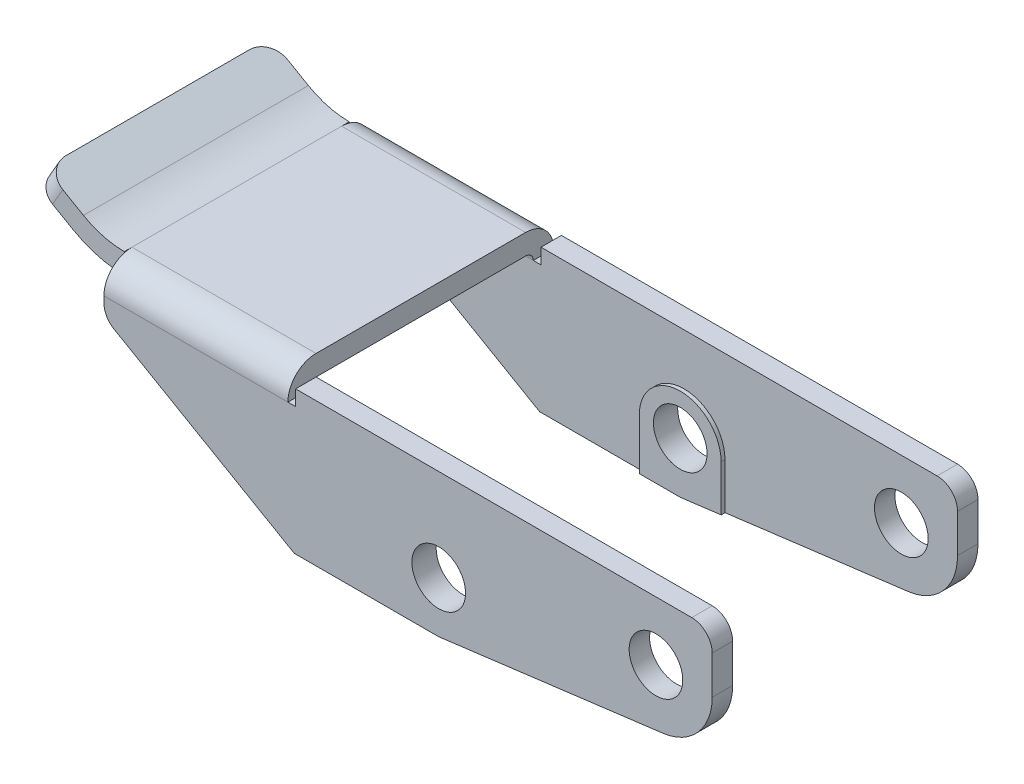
ISO-10303-21;
HEADER;
FILE_DESCRIPTION(('STEP AP214'),'2;1');
FILE_NAME('part.step','',(''),(''),'','','');
FILE_SCHEMA(('AUTOMOTIVE_DESIGN { 1 0 10303 214 1 1 1 1 }'));
ENDSEC;
DATA;
#1=APPLICATION_CONTEXT('core data for automotive mechanical design processes');
#2=APPLICATION_PROTOCOL_DEFINITION('international standard','automotive_design',2000,#1);
#3=PRODUCT_CONTEXT('',#1,'mechanical');
#4=PRODUCT('Part','Part','',(#3));
#5=PRODUCT_RELATED_PRODUCT_CATEGORY('part','',(#4));
#6=PRODUCT_DEFINITION_FORMATION('','',#4);
#7=PRODUCT_DEFINITION_CONTEXT('part definition',#1,'design');
#8=PRODUCT_DEFINITION('design','',#6,#7);
#9=PRODUCT_DEFINITION_SHAPE('','',#8);
#10=(LENGTH_UNIT() NAMED_UNIT(*) SI_UNIT(.MILLI.,.METRE.));
#11=(NAMED_UNIT(*) PLANE_ANGLE_UNIT() SI_UNIT($,.RADIAN.));
#12=(NAMED_UNIT(*) SI_UNIT($,.STERADIAN.) SOLID_ANGLE_UNIT());
#13=UNCERTAINTY_MEASURE_WITH_UNIT(LENGTH_MEASURE(1.E-05),#10,'distance_accuracy_value','');
#14=(GEOMETRIC_REPRESENTATION_CONTEXT(3) GLOBAL_UNCERTAINTY_ASSIGNED_CONTEXT((#13)) GLOBAL_UNIT_ASSIGNED_CONTEXT((#10,
#11,#12)) REPRESENTATION_CONTEXT('',''));
#15=CARTESIAN_POINT('',(0.,0.,0.));
#16=DIRECTION('',(0.,0.,1.));
#17=DIRECTION('',(1.,0.,0.));
#18=AXIS2_PLACEMENT_3D('',#15,#16,#17);
#19=CARTESIAN_POINT('',(-19.8859883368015,12.4779958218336,-4.1));
#20=DIRECTION('',(-1.,0.,0.));
#21=DIRECTION('',(0.,0.,1.));
#22=AXIS2_PLACEMENT_3D('',#19,#20,#21);
#23=CYLINDRICAL_SURFACE('',#22,0.300000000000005);
#24=DIRECTION('',(1.,0.,0.));
#25=VECTOR('',#24,1.);
#26=CARTESIAN_POINT('',(-25.5359883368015,12.4779958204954,-4.40000000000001));
#27=LINE('',#26,#25);
#28=CARTESIAN_POINT('',(-31.1859883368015,12.4779958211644,-4.4));
#29=VERTEX_POINT('',#28);
#30=CARTESIAN_POINT('',(-23.9859883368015,12.4779958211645,-4.40000000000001));
#31=VERTEX_POINT('',#30);
#32=EDGE_CURVE('E579',#29,#31,#27,.T.);
#33=ORIENTED_EDGE('',*,*,#32,.T.);
#34=CARTESIAN_POINT('',(-23.9859883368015,12.4779958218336,-4.1));
#35=DIRECTION('',(-1.,0.,0.));
#36=DIRECTION('',(0.,0.,-1.));
#37=AXIS2_PLACEMENT_3D('',#34,#35,#36);
#38=CIRCLE('',#37,0.300000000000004);
#39=CARTESIAN_POINT('',(-23.9859883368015,12.7779958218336,-4.0999999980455));
#40=VERTEX_POINT('',#39);
#41=EDGE_CURVE('E362',#40,#31,#38,.T.);
#42=ORIENTED_EDGE('',*,*,#41,.F.);
#43=DIRECTION('',(-1.,0.,0.));
#44=VECTOR('',#43,1.);
#45=CARTESIAN_POINT('',(-25.5359883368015,12.7779958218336,-4.09999999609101));
#46=LINE('',#45,#44);
#47=CARTESIAN_POINT('',(-31.1859883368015,12.7779958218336,-4.09999999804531));
#48=VERTEX_POINT('',#47);
#49=EDGE_CURVE('E569',#40,#48,#46,.T.);
#50=ORIENTED_EDGE('',*,*,#49,.T.);
#51=CARTESIAN_POINT('',(-31.1859883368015,12.4779958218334,-4.09999999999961));
#52=DIRECTION('',(-1.,0.,0.));
#53=DIRECTION('',(0.,0.,1.));
#54=AXIS2_PLACEMENT_3D('',#51,#52,#53);
#55=CIRCLE('',#54,0.300000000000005);
#56=EDGE_CURVE('E414',#29,#48,#55,.F.);
#57=ORIENTED_EDGE('',*,*,#56,.F.);
#58=EDGE_LOOP('',(#33,#42,#50,#57));
#59=FACE_BOUND('',#58,.T.);
#60=ADVANCED_FACE('F34',(#59),#23,.F.);
#61=CARTESIAN_POINT('',(-18.8859883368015,12.7779958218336,4.4));
#62=DIRECTION('',(0.,1.,0.));
#63=DIRECTION('',(0.,0.,-1.));
#64=AXIS2_PLACEMENT_3D('',#61,#62,#63);
#65=PLANE('',#64);
#66=DIRECTION('',(0.,0.,-1.));
#67=VECTOR('',#66,1.);
#68=CARTESIAN_POINT('',(-23.9859883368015,12.7779958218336,4.09999999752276));
#69=LINE('',#68,#67);
#70=CARTESIAN_POINT('',(-23.9859883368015,12.7779958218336,4.09999999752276));
#71=VERTEX_POINT('',#70);
#72=EDGE_CURVE('E360',#71,#40,#69,.T.);
#73=ORIENTED_EDGE('',*,*,#72,.F.);
#74=DIRECTION('',(1.,0.,0.));
#75=VECTOR('',#74,1.);
#76=CARTESIAN_POINT('',(-25.5359883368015,12.7779958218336,4.09999999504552));
#77=LINE('',#76,#75);
#78=CARTESIAN_POINT('',(-31.1859883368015,12.7779958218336,4.09999999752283));
#79=VERTEX_POINT('',#78);
#80=EDGE_CURVE('E555',#79,#71,#77,.T.);
#81=ORIENTED_EDGE('',*,*,#80,.F.);
#82=DIRECTION('',(0.,0.,1.));
#83=VECTOR('',#82,1.);
#84=CARTESIAN_POINT('',(-31.1859883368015,12.7779958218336,0.));
#85=LINE('',#84,#83);
#86=EDGE_CURVE('E565',#48,#79,#85,.T.);
#87=ORIENTED_EDGE('',*,*,#86,.F.);
#88=ORIENTED_EDGE('',*,*,#49,.F.);
#89=EDGE_LOOP('',(#73,#81,#87,#88));
#90=FACE_BOUND('',#89,.T.);
#91=ADVANCED_FACE('F795',(#90),#65,.F.);
#92=CARTESIAN_POINT('',(-19.8859883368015,12.4779958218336,-4.1));
#93=DIRECTION('',(-1.,0.,0.));
#94=DIRECTION('',(0.,0.,1.));
#95=AXIS2_PLACEMENT_3D('',#92,#93,#94);
#96=CYLINDRICAL_SURFACE('',#95,1.1);
#97=CARTESIAN_POINT('',(-23.9859883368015,12.4779958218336,-4.1));
#98=DIRECTION('',(1.,0.,0.));
#99=DIRECTION('',(0.,0.,-1.));
#100=AXIS2_PLACEMENT_3D('',#97,#98,#99);
#101=CIRCLE('',#100,1.1);
#102=CARTESIAN_POINT('',(-23.9859883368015,12.4779958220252,-5.2));
#103=VERTEX_POINT('',#102);
#104=CARTESIAN_POINT('',(-23.9859883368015,13.5779958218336,-4.1));
#105=VERTEX_POINT('',#104);
#106=EDGE_CURVE('E378',#103,#105,#101,.T.);
#107=ORIENTED_EDGE('',*,*,#106,.F.);
#108=DIRECTION('',(1.,0.,0.));
#109=VECTOR('',#108,1.);
#110=CARTESIAN_POINT('',(-25.5359883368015,12.4779958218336,-5.2));
#111=LINE('',#110,#109);
#112=CARTESIAN_POINT('',(-31.1859883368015,12.4779958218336,-5.2));
#113=VERTEX_POINT('',#112);
#114=EDGE_CURVE('E573',#113,#103,#111,.T.);
#115=ORIENTED_EDGE('',*,*,#114,.F.);
#116=CARTESIAN_POINT('',(-31.1859883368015,12.4779958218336,-4.1));
#117=DIRECTION('',(-1.,0.,0.));
#118=DIRECTION('',(0.,0.,1.));
#119=AXIS2_PLACEMENT_3D('',#116,#117,#118);
#120=CIRCLE('',#119,1.1);
#121=CARTESIAN_POINT('',(-31.1859883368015,13.5362963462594,-4.4));
#122=VERTEX_POINT('',#121);
#123=EDGE_CURVE('E710',#122,#113,#120,.T.);
#124=ORIENTED_EDGE('',*,*,#123,.F.);
#125=CARTESIAN_POINT('',(-31.1859883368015,12.4779958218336,-4.1));
#126=DIRECTION('',(-1.,0.,0.));
#127=DIRECTION('',(0.,0.,1.));
#128=AXIS2_PLACEMENT_3D('',#125,#126,#127);
#129=CIRCLE('',#128,1.1);
#130=CARTESIAN_POINT('',(-31.1859883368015,13.5779958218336,-4.1));
#131=VERTEX_POINT('',#130);
#132=EDGE_CURVE('E568',#131,#122,#129,.T.);
#133=ORIENTED_EDGE('',*,*,#132,.F.);
#134=DIRECTION('',(-1.,0.,0.));
#135=VECTOR('',#134,1.);
#136=CARTESIAN_POINT('',(-25.0359883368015,13.5779958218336,-4.1));
#137=LINE('',#136,#135);
#138=EDGE_CURVE('E434',#105,#131,#137,.T.);
#139=ORIENTED_EDGE('',*,*,#138,.F.);
#140=EDGE_LOOP('',(#107,#115,#124,#133,#139));
#141=FACE_BOUND('',#140,.T.);
#142=ADVANCED_FACE('F814',(#141),#96,.T.);
#143=CARTESIAN_POINT('',(-19.8859883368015,12.4779958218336,4.10000000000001));
#144=DIRECTION('',(-1.,0.,0.));
#145=DIRECTION('',(0.,-1.,0.));
#146=AXIS2_PLACEMENT_3D('',#143,#144,#145);
#147=CYLINDRICAL_SURFACE('',#146,0.300000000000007);
#148=ORIENTED_EDGE('',*,*,#80,.T.);
#149=CARTESIAN_POINT('',(-23.9859883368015,12.4779958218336,4.10000000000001));
#150=DIRECTION('',(-1.,0.,0.));
#151=DIRECTION('',(0.,0.,-1.));
#152=AXIS2_PLACEMENT_3D('',#149,#150,#151);
#153=CIRCLE('',#152,0.299999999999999);
#154=CARTESIAN_POINT('',(-23.9859883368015,12.4779958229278,4.4));
#155=VERTEX_POINT('',#154);
#156=EDGE_CURVE('E356',#155,#71,#153,.T.);
#157=ORIENTED_EDGE('',*,*,#156,.F.);
#158=DIRECTION('',(-1.,0.,0.));
#159=VECTOR('',#158,1.);
#160=CARTESIAN_POINT('',(-19.9414929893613,12.4779958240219,4.4));
#161=LINE('',#160,#159);
#162=CARTESIAN_POINT('',(-31.1859883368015,12.4779958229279,4.4));
#163=VERTEX_POINT('',#162);
#164=EDGE_CURVE('E444',#155,#163,#161,.T.);
#165=ORIENTED_EDGE('',*,*,#164,.T.);
#166=CARTESIAN_POINT('',(-31.1859883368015,12.4779958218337,4.10000000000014));
#167=DIRECTION('',(-1.,0.,0.));
#168=DIRECTION('',(0.,-1.,0.));
#169=AXIS2_PLACEMENT_3D('',#166,#167,#168);
#170=CIRCLE('',#169,0.300000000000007);
#171=EDGE_CURVE('E440',#79,#163,#170,.F.);
#172=ORIENTED_EDGE('',*,*,#171,.F.);
#173=EDGE_LOOP('',(#148,#157,#165,#172));
#174=FACE_BOUND('',#173,.T.);
#175=ADVANCED_FACE('F781',(#174),#147,.F.);
#176=CARTESIAN_POINT('',(-18.8859883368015,13.5779958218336,-5.2));
#177=DIRECTION('',(0.,1.,0.));
#178=DIRECTION('',(-1.,0.,0.));
#179=AXIS2_PLACEMENT_3D('',#176,#177,#178);
#180=PLANE('',#179);
#181=DIRECTION('',(1.,0.,0.));
#182=VECTOR('',#181,1.);
#183=CARTESIAN_POINT('',(-25.5359883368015,13.5779958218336,4.1));
#184=LINE('',#183,#182);
#185=CARTESIAN_POINT('',(-31.1859883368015,13.5779958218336,4.1));
#186=VERTEX_POINT('',#185);
#187=CARTESIAN_POINT('',(-23.9859883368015,13.5779958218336,4.1));
#188=VERTEX_POINT('',#187);
#189=EDGE_CURVE('E511',#186,#188,#184,.T.);
#190=ORIENTED_EDGE('',*,*,#189,.T.);
#191=DIRECTION('',(0.,0.,1.));
#192=VECTOR('',#191,1.);
#193=CARTESIAN_POINT('',(-23.9859883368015,13.5779958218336,-4.1));
#194=LINE('',#193,#192);
#195=EDGE_CURVE('E368',#105,#188,#194,.T.);
#196=ORIENTED_EDGE('',*,*,#195,.F.);
#197=ORIENTED_EDGE('',*,*,#138,.T.);
#198=DIRECTION('',(0.,0.,1.));
#199=VECTOR('',#198,1.);
#200=CARTESIAN_POINT('',(-31.1859883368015,13.5779958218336,0.));
#201=LINE('',#200,#199);
#202=EDGE_CURVE('E538',#131,#186,#201,.T.);
#203=ORIENTED_EDGE('',*,*,#202,.T.);
#204=EDGE_LOOP('',(#190,#196,#197,#203));
#205=FACE_BOUND('',#204,.T.);
#206=ADVANCED_FACE('F838',(#205),#180,.T.);
#207=CARTESIAN_POINT('',(-19.8859883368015,12.4779958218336,4.1));
#208=DIRECTION('',(-1.,0.,0.));
#209=DIRECTION('',(0.,0.,1.));
#210=AXIS2_PLACEMENT_3D('',#207,#208,#209);
#211=CYLINDRICAL_SURFACE('',#210,1.1);
#212=CARTESIAN_POINT('',(-23.9859883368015,12.4779958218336,4.1));
#213=DIRECTION('',(1.,0.,0.));
#214=DIRECTION('',(0.,0.,-1.));
#215=AXIS2_PLACEMENT_3D('',#212,#213,#214);
#216=CIRCLE('',#215,1.1);
#217=CARTESIAN_POINT('',(-23.9859883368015,12.4779958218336,5.2));
#218=VERTEX_POINT('',#217);
#219=EDGE_CURVE('E370',#188,#218,#216,.T.);
#220=ORIENTED_EDGE('',*,*,#219,.F.);
#221=ORIENTED_EDGE('',*,*,#189,.F.);
#222=CARTESIAN_POINT('',(-31.1859883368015,12.4779958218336,4.1));
#223=DIRECTION('',(-1.,0.,0.));
#224=DIRECTION('',(0.,0.,1.));
#225=AXIS2_PLACEMENT_3D('',#222,#223,#224);
#226=CIRCLE('',#225,1.1);
#227=CARTESIAN_POINT('',(-31.1859883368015,13.5362963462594,4.4));
#228=VERTEX_POINT('',#227);
#229=EDGE_CURVE('E543',#228,#186,#226,.T.);
#230=ORIENTED_EDGE('',*,*,#229,.F.);
#231=CARTESIAN_POINT('',(-31.1859883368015,12.4779958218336,4.1));
#232=DIRECTION('',(-1.,0.,0.));
#233=DIRECTION('',(0.,0.,1.));
#234=AXIS2_PLACEMENT_3D('',#231,#232,#233);
#235=CIRCLE('',#234,1.1);
#236=CARTESIAN_POINT('',(-31.1859883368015,12.4779958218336,5.2));
#237=VERTEX_POINT('',#236);
#238=EDGE_CURVE('E516',#237,#228,#235,.T.);
#239=ORIENTED_EDGE('',*,*,#238,.F.);
#240=DIRECTION('',(-1.,0.,0.));
#241=VECTOR('',#240,1.);
#242=CARTESIAN_POINT('',(-19.4447386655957,12.4779958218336,5.2));
#243=LINE('',#242,#241);
#244=EDGE_CURVE('E466',#218,#237,#243,.T.);
#245=ORIENTED_EDGE('',*,*,#244,.F.);
#246=EDGE_LOOP('',(#220,#221,#230,#239,#245));
#247=FACE_BOUND('',#246,.T.);
#248=ADVANCED_FACE('F842',(#247),#211,.T.);
#249=CARTESIAN_POINT('',(-16.4859883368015,7.6817115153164,-4.4));
#250=DIRECTION('',(1.,0.,0.));
#251=DIRECTION('',(0.,1.,0.));
#252=AXIS2_PLACEMENT_3D('',#249,#250,#251);
#253=PLANE('',#252);
#254=DIRECTION('',(0.,0.,-1.));
#255=VECTOR('',#254,1.);
#256=CARTESIAN_POINT('',(-16.4859883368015,7.6817115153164,-4.325));
#257=LINE('',#256,#255);
#258=CARTESIAN_POINT('',(-16.4859883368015,7.68171151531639,-4.25));
#259=VERTEX_POINT('',#258);
#260=CARTESIAN_POINT('',(-16.4859883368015,7.68171151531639,-4.4));
#261=VERTEX_POINT('',#260);
#262=EDGE_CURVE('E380',#259,#261,#257,.T.);
#263=ORIENTED_EDGE('',*,*,#262,.T.);
#264=DIRECTION('',(0.,1.,0.));
#265=VECTOR('',#264,1.);
#266=CARTESIAN_POINT('',(-16.4859883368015,9.77799582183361,-4.4));
#267=LINE('',#266,#265);
#268=CARTESIAN_POINT('',(-16.4859883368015,9.47799582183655,-4.4));
#269=VERTEX_POINT('',#268);
#270=EDGE_CURVE('E384',#261,#269,#267,.T.);
#271=ORIENTED_EDGE('',*,*,#270,.T.);
#272=DIRECTION('',(0.,0.,-1.));
#273=VECTOR('',#272,1.);
#274=CARTESIAN_POINT('',(-16.4859883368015,9.47799582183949,-4.325));
#275=LINE('',#274,#273);
#276=CARTESIAN_POINT('',(-16.4859883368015,9.47799582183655,-4.25));
#277=VERTEX_POINT('',#276);
#278=EDGE_CURVE('E663',#277,#269,#275,.T.);
#279=ORIENTED_EDGE('',*,*,#278,.F.);
#280=DIRECTION('',(0.,1.,0.));
#281=VECTOR('',#280,1.);
#282=CARTESIAN_POINT('',(-16.4859883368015,9.27799573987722,-4.25));
#283=LINE('',#282,#281);
#284=EDGE_CURVE('E381',#259,#277,#283,.T.);
#285=ORIENTED_EDGE('',*,*,#284,.F.);
#286=EDGE_LOOP('',(#263,#271,#279,#285));
#287=FACE_BOUND('',#286,.T.);
#288=ADVANCED_FACE('F946',(#287),#253,.T.);
#289=CARTESIAN_POINT('',(-18.0859883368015,9.47799582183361,-4.4));
#290=DIRECTION('',(0.,0.,1.));
#291=DIRECTION('',(1.,0.,0.));
#292=AXIS2_PLACEMENT_3D('',#289,#290,#291);
#293=CYLINDRICAL_SURFACE('',#292,1.6);
#294=ORIENTED_EDGE('',*,*,#278,.T.);
#295=CARTESIAN_POINT('',(-18.0859883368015,9.47799582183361,-4.4));
#296=DIRECTION('',(0.,0.,1.));
#297=DIRECTION('',(1.,0.,0.));
#298=AXIS2_PLACEMENT_3D('',#295,#296,#297);
#299=CIRCLE('',#298,1.6);
#300=CARTESIAN_POINT('',(-19.6859866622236,9.48031069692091,-4.4));
#301=VERTEX_POINT('',#300);
#302=EDGE_CURVE('E393',#269,#301,#299,.T.);
#303=ORIENTED_EDGE('',*,*,#302,.T.);
#304=DIRECTION('',(0.,0.,-1.));
#305=VECTOR('',#304,1.);
#306=CARTESIAN_POINT('',(-19.6859866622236,9.48031069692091,-4.325));
#307=LINE('',#306,#305);
#308=CARTESIAN_POINT('',(-19.6859866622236,9.48031069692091,-4.25));
#309=VERTEX_POINT('',#308);
#310=EDGE_CURVE('E657',#309,#301,#307,.T.);
#311=ORIENTED_EDGE('',*,*,#310,.F.);
#312=CARTESIAN_POINT('',(-18.0859883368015,9.47799582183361,-4.25));
#313=DIRECTION('',(0.,0.,1.));
#314=DIRECTION('',(1.,0.,0.));
#315=AXIS2_PLACEMENT_3D('',#312,#313,#314);
#316=CIRCLE('',#315,1.6);
#317=EDGE_CURVE('E660',#277,#309,#316,.T.);
#318=ORIENTED_EDGE('',*,*,#317,.F.);
#319=EDGE_LOOP('',(#294,#303,#311,#318));
#320=FACE_BOUND('',#319,.T.);
#321=ADVANCED_FACE('F951',(#320),#293,.T.);
#322=CARTESIAN_POINT('',(-19.6859866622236,9.48031069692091,-4.4));
#323=DIRECTION('',(-0.999998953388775,0.00144679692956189,0.));
#324=DIRECTION('',(-0.00144679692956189,-0.999998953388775,0.));
#325=AXIS2_PLACEMENT_3D('',#322,#323,#324);
#326=PLANE('',#325);
#327=ORIENTED_EDGE('',*,*,#310,.T.);
#328=DIRECTION('',(-0.00144679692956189,-0.999998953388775,0.));
#329=VECTOR('',#328,1.);
#330=CARTESIAN_POINT('',(-19.6859866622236,9.48031069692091,-4.4));
#331=LINE('',#330,#329);
#332=CARTESIAN_POINT('',(-19.6888836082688,7.47799582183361,-4.4));
#333=VERTEX_POINT('',#332);
#334=EDGE_CURVE('E391',#301,#333,#331,.T.);
#335=ORIENTED_EDGE('',*,*,#334,.T.);
#336=DIRECTION('',(0.,0.,1.));
#337=VECTOR('',#336,1.);
#338=CARTESIAN_POINT('',(-19.6888836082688,7.47799582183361,-4.325));
#339=LINE('',#338,#337);
#340=CARTESIAN_POINT('',(-19.6888836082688,7.47799582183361,-4.25));
#341=VERTEX_POINT('',#340);
#342=EDGE_CURVE('E661',#333,#341,#339,.T.);
#343=ORIENTED_EDGE('',*,*,#342,.T.);
#344=DIRECTION('',(-0.00144679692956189,-0.999998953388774,0.));
#345=VECTOR('',#344,1.);
#346=CARTESIAN_POINT('',(-19.6859866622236,9.48031069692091,-4.25));
#347=LINE('',#346,#345);
#348=EDGE_CURVE('E385',#309,#341,#347,.T.);
#349=ORIENTED_EDGE('',*,*,#348,.F.);
#350=EDGE_LOOP('',(#327,#335,#343,#349));
#351=FACE_BOUND('',#350,.T.);
#352=ADVANCED_FACE('F1086',(#351),#326,.T.);
#353=CARTESIAN_POINT('',(-16.4059159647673,11.1679956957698,-4.25));
#354=DIRECTION('',(0.,0.,1.));
#355=DIRECTION('',(-1.,0.,0.));
#356=AXIS2_PLACEMENT_3D('',#353,#354,#355);
#357=PLANE('',#356);
#358=CARTESIAN_POINT('',(-18.0859883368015,9.47799582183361,-4.25));
#359=DIRECTION('',(0.,0.,-1.));
#360=DIRECTION('',(-1.,0.,0.));
#361=AXIS2_PLACEMENT_3D('',#358,#359,#360);
#362=CIRCLE('',#361,1.05);
#363=CARTESIAN_POINT('',(-19.1359883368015,9.47799582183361,-4.25));
#364=VERTEX_POINT('',#363);
#365=EDGE_CURVE('E594',#364,#364,#362,.T.);
#366=ORIENTED_EDGE('',*,*,#365,.T.);
#367=EDGE_LOOP('',(#366));
#368=FACE_BOUND('',#367,.T.);
#369=DIRECTION('',(-0.991991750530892,-0.126302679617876,0.));
#370=VECTOR('',#369,1.);
#371=CARTESIAN_POINT('',(-13.6970553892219,8.03680489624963,-4.25));
#372=LINE('',#371,#370);
#373=CARTESIAN_POINT('',(-18.0859883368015,7.47799582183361,-4.25));
#374=VERTEX_POINT('',#373);
#375=EDGE_CURVE('E625',#259,#374,#372,.T.);
#376=ORIENTED_EDGE('',*,*,#375,.F.);
#377=ORIENTED_EDGE('',*,*,#284,.T.);
#378=ORIENTED_EDGE('',*,*,#317,.T.);
#379=ORIENTED_EDGE('',*,*,#348,.T.);
#380=DIRECTION('',(-1.,0.,0.));
#381=VECTOR('',#380,1.);
#382=CARTESIAN_POINT('',(-20.9120791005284,7.47799582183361,-4.25));
#383=LINE('',#382,#381);
#384=EDGE_CURVE('E642',#374,#341,#383,.T.);
#385=ORIENTED_EDGE('',*,*,#384,.F.);
#386=EDGE_LOOP('',(#376,#377,#378,#379,#385));
#387=FACE_BOUND('',#386,.T.);
#388=ADVANCED_FACE('F1025',(#368,#387),#357,.T.);
#389=CARTESIAN_POINT('',(-5.28598833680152,13.1779958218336,-4.4));
#390=DIRECTION('',(0.,0.,-1.));
#391=DIRECTION('',(0.,-1.,0.));
#392=AXIS2_PLACEMENT_3D('',#389,#390,#391);
#393=PLANE('',#392);
#394=DIRECTION('',(0.,1.,0.));
#395=VECTOR('',#394,1.);
#396=CARTESIAN_POINT('',(-23.6859883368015,12.0779958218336,-4.4));
#397=LINE('',#396,#395);
#398=CARTESIAN_POINT('',(-23.6859883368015,12.4779958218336,-4.4));
#399=VERTEX_POINT('',#398);
#400=CARTESIAN_POINT('',(-23.6859883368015,13.0779958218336,-4.4));
#401=VERTEX_POINT('',#400);
#402=EDGE_CURVE('E341',#399,#401,#397,.T.);
#403=ORIENTED_EDGE('',*,*,#402,.F.);
#404=DIRECTION('',(1.,0.,0.));
#405=VECTOR('',#404,1.);
#406=CARTESIAN_POINT('',(-23.9859883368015,12.4779958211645,-4.40000000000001));
#407=LINE('',#406,#405);
#408=EDGE_CURVE('E375',#31,#399,#407,.T.);
#409=ORIENTED_EDGE('',*,*,#408,.F.);
#410=ORIENTED_EDGE('',*,*,#32,.F.);
#411=DIRECTION('',(0.,1.,0.));
#412=VECTOR('',#411,1.);
#413=CARTESIAN_POINT('',(-31.1859883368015,9.77799582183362,-4.4));
#414=LINE('',#413,#412);
#415=CARTESIAN_POINT('',(-31.1859883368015,12.2398760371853,-4.4));
#416=VERTEX_POINT('',#415);
#417=EDGE_CURVE('E388',#416,#29,#414,.T.);
#418=ORIENTED_EDGE('',*,*,#417,.F.);
#419=CARTESIAN_POINT('',(-30.3859883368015,12.2398760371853,-4.4));
#420=DIRECTION('',(0.,0.,1.));
#421=DIRECTION('',(1.,0.,0.));
#422=AXIS2_PLACEMENT_3D('',#419,#420,#421);
#423=CIRCLE('',#422,0.800000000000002);
#424=CARTESIAN_POINT('',(-30.7859883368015,11.5470557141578,-4.4));
#425=VERTEX_POINT('',#424);
#426=EDGE_CURVE('E603',#425,#416,#423,.F.);
#427=ORIENTED_EDGE('',*,*,#426,.F.);
#428=DIRECTION('',(-0.866025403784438,0.500000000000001,0.));
#429=VECTOR('',#428,1.);
#430=CARTESIAN_POINT('',(-27.2620791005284,9.51252576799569,-4.4));
#431=LINE('',#430,#429);
#432=CARTESIAN_POINT('',(-23.7381698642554,7.47799582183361,-4.4));
#433=VERTEX_POINT('',#432);
#434=EDGE_CURVE('E604',#433,#425,#431,.T.);
#435=ORIENTED_EDGE('',*,*,#434,.F.);
#436=DIRECTION('',(-1.,0.,0.));
#437=VECTOR('',#436,1.);
#438=CARTESIAN_POINT('',(-20.9120791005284,7.47799582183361,-4.4));
#439=LINE('',#438,#437);
#440=EDGE_CURVE('E618',#333,#433,#439,.T.);
#441=ORIENTED_EDGE('',*,*,#440,.F.);
#442=ORIENTED_EDGE('',*,*,#334,.F.);
#443=ORIENTED_EDGE('',*,*,#302,.F.);
#444=ORIENTED_EDGE('',*,*,#270,.F.);
#445=DIRECTION('',(-0.991991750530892,-0.126302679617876,0.));
#446=VECTOR('',#445,1.);
#447=CARTESIAN_POINT('',(-13.6970553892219,8.03680489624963,-4.4));
#448=LINE('',#447,#446);
#449=CARTESIAN_POINT('',(-9.30812244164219,8.59561397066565,-4.4));
#450=VERTEX_POINT('',#449);
#451=EDGE_CURVE('E624',#450,#261,#448,.T.);
#452=ORIENTED_EDGE('',*,*,#451,.F.);
#453=CARTESIAN_POINT('',(-9.58598833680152,10.7779958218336,-4.4));
#454=DIRECTION('',(0.,0.,1.));
#455=DIRECTION('',(1.,0.,0.));
#456=AXIS2_PLACEMENT_3D('',#453,#454,#455);
#457=CIRCLE('',#456,2.19999999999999);
#458=CARTESIAN_POINT('',(-7.38598833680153,10.7779958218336,-4.4));
#459=VERTEX_POINT('',#458);
#460=EDGE_CURVE('E629',#459,#450,#457,.F.);
#461=ORIENTED_EDGE('',*,*,#460,.F.);
#462=DIRECTION('',(0.,-1.,0.));
#463=VECTOR('',#462,1.);
#464=CARTESIAN_POINT('',(-7.38598833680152,12.1779958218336,-4.4));
#465=LINE('',#464,#463);
#466=CARTESIAN_POINT('',(-7.38598833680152,12.2779958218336,-4.4));
#467=VERTEX_POINT('',#466);
#468=EDGE_CURVE('E398',#467,#459,#465,.T.);
#469=ORIENTED_EDGE('',*,*,#468,.F.);
#470=CARTESIAN_POINT('',(-8.18598833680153,12.2779958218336,-4.4));
#471=DIRECTION('',(0.,0.,1.));
#472=DIRECTION('',(1.,0.,0.));
#473=AXIS2_PLACEMENT_3D('',#470,#471,#472);
#474=CIRCLE('',#473,0.800000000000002);
#475=CARTESIAN_POINT('',(-8.18598833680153,13.0779958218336,-4.4));
#476=VERTEX_POINT('',#475);
#477=EDGE_CURVE('E595',#476,#467,#474,.F.);
#478=ORIENTED_EDGE('',*,*,#477,.F.);
#479=DIRECTION('',(-1.,0.,0.));
#480=VECTOR('',#479,1.);
#481=CARTESIAN_POINT('',(-12.6359883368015,13.0779958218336,-4.4));
#482=LINE('',#481,#480);
#483=EDGE_CURVE('E597',#476,#401,#482,.T.);
#484=ORIENTED_EDGE('',*,*,#483,.T.);
#485=EDGE_LOOP('',(#403,#409,#410,#418,#427,#435,#441,#442,#443,#444,#452,#461,#469,#478,#484));
#486=FACE_BOUND('',#485,.T.);
#487=CARTESIAN_POINT('',(-9.58598833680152,10.7779958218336,-4.4));
#488=DIRECTION('',(0.,0.,-1.));
#489=DIRECTION('',(-1.,0.,0.));
#490=AXIS2_PLACEMENT_3D('',#487,#488,#489);
#491=CIRCLE('',#490,1.05);
#492=CARTESIAN_POINT('',(-10.6359883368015,10.7779958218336,-4.4));
#493=VERTEX_POINT('',#492);
#494=EDGE_CURVE('E633',#493,#493,#491,.T.);
#495=ORIENTED_EDGE('',*,*,#494,.T.);
#496=EDGE_LOOP('',(#495));
#497=FACE_BOUND('',#496,.T.);
#498=ADVANCED_FACE('F804',(#486,#497),#393,.F.);
#499=CARTESIAN_POINT('',(-34.6859883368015,14.1799196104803,-5.2));
#500=DIRECTION('',(-0.499999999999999,-0.866025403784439,0.));
#501=DIRECTION('',(0.866025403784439,-0.499999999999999,0.));
#502=AXIS2_PLACEMENT_3D('',#499,#500,#501);
#503=PLANE('',#502);
#504=DIRECTION('',(0.,0.,1.));
#505=VECTOR('',#504,1.);
#506=CARTESIAN_POINT('',(-34.6859883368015,14.1799196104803,0.));
#507=LINE('',#506,#505);
#508=CARTESIAN_POINT('',(-34.6859883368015,14.1799196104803,-3.6));
#509=VERTEX_POINT('',#508);
#510=CARTESIAN_POINT('',(-34.6859883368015,14.1799196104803,3.6));
#511=VERTEX_POINT('',#510);
#512=EDGE_CURVE('E590',#509,#511,#507,.T.);
#513=ORIENTED_EDGE('',*,*,#512,.F.);
#514=CARTESIAN_POINT('',(-33.993168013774,13.7799196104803,-3.59999999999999));
#515=DIRECTION('',(-0.499999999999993,-0.866025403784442,0.));
#516=DIRECTION('',(0.866025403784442,-0.499999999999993,0.));
#517=AXIS2_PLACEMENT_3D('',#514,#515,#516);
#518=CIRCLE('',#517,0.800000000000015);
#519=CARTESIAN_POINT('',(-33.993168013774,13.7799196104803,-4.4));
#520=VERTEX_POINT('',#519);
#521=EDGE_CURVE('E585',#520,#509,#518,.F.);
#522=ORIENTED_EDGE('',*,*,#521,.F.);
#523=DIRECTION('',(0.866025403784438,-0.500000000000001,0.));
#524=VECTOR('',#523,1.);
#525=CARTESIAN_POINT('',(-33.9359883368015,13.7469069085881,-4.4));
#526=LINE('',#525,#524);
#527=CARTESIAN_POINT('',(-33.1859883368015,13.3138942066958,-4.4));
#528=VERTEX_POINT('',#527);
#529=EDGE_CURVE('E390',#520,#528,#526,.T.);
#530=ORIENTED_EDGE('',*,*,#529,.T.);
#531=DIRECTION('',(0.,0.,-1.));
#532=VECTOR('',#531,1.);
#533=CARTESIAN_POINT('',(-33.1859883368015,13.3138942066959,0.));
#534=LINE('',#533,#532);
#535=CARTESIAN_POINT('',(-33.1859883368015,13.3138942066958,4.4));
#536=VERTEX_POINT('',#535);
#537=EDGE_CURVE('E403',#536,#528,#534,.T.);
#538=ORIENTED_EDGE('',*,*,#537,.F.);
#539=DIRECTION('',(-0.866025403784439,0.499999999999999,0.));
#540=VECTOR('',#539,1.);
#541=CARTESIAN_POINT('',(-33.9359883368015,13.7469069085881,4.4));
#542=LINE('',#541,#540);
#543=CARTESIAN_POINT('',(-33.993168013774,13.7799196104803,4.4));
#544=VERTEX_POINT('',#543);
#545=EDGE_CURVE('E396',#536,#544,#542,.T.);
#546=ORIENTED_EDGE('',*,*,#545,.T.);
#547=CARTESIAN_POINT('',(-33.993168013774,13.7799196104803,3.6));
#548=DIRECTION('',(0.499999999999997,0.86602540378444,0.));
#549=DIRECTION('',(-0.86602540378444,0.499999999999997,0.));
#550=AXIS2_PLACEMENT_3D('',#547,#548,#549);
#551=CIRCLE('',#550,0.799999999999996);
#552=EDGE_CURVE('E589',#511,#544,#551,.T.);
#553=ORIENTED_EDGE('',*,*,#552,.F.);
#554=EDGE_LOOP('',(#513,#522,#530,#538,#546,#553));
#555=FACE_BOUND('',#554,.T.);
#556=ADVANCED_FACE('F1024',(#555),#503,.T.);
#557=CARTESIAN_POINT('',(-7.38598833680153,10.7779958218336,-5.2));
#558=DIRECTION('',(1.,0.,0.));
#559=DIRECTION('',(0.,1.,0.));
#560=AXIS2_PLACEMENT_3D('',#557,#558,#559);
#561=PLANE('',#560);
#562=DIRECTION('',(0.,-1.,0.));
#563=VECTOR('',#562,1.);
#564=CARTESIAN_POINT('',(-7.38598833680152,10.6855616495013,-5.2));
#565=LINE('',#564,#563);
#566=CARTESIAN_POINT('',(-7.38598833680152,12.2779958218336,-5.2));
#567=VERTEX_POINT('',#566);
#568=CARTESIAN_POINT('',(-7.38598833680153,10.7779958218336,-5.2));
#569=VERTEX_POINT('',#568);
#570=EDGE_CURVE('E410',#567,#569,#565,.T.);
#571=ORIENTED_EDGE('',*,*,#570,.F.);
#572=DIRECTION('',(0.,0.,-1.));
#573=VECTOR('',#572,1.);
#574=CARTESIAN_POINT('',(-7.38598833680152,12.2779958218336,-4.8));
#575=LINE('',#574,#573);
#576=EDGE_CURVE('E591',#467,#567,#575,.T.);
#577=ORIENTED_EDGE('',*,*,#576,.F.);
#578=ORIENTED_EDGE('',*,*,#468,.T.);
#579=DIRECTION('',(0.,0.,1.));
#580=VECTOR('',#579,1.);
#581=CARTESIAN_POINT('',(-7.38598833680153,10.7779958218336,0.));
#582=LINE('',#581,#580);
#583=EDGE_CURVE('E626',#569,#459,#582,.T.);
#584=ORIENTED_EDGE('',*,*,#583,.F.);
#585=EDGE_LOOP('',(#571,#577,#578,#584));
#586=FACE_BOUND('',#585,.T.);
#587=ADVANCED_FACE('F1112',(#586),#561,.T.);
#588=CARTESIAN_POINT('',(-9.58598833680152,10.7779958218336,-5.2));
#589=DIRECTION('',(0.,0.,1.));
#590=DIRECTION('',(1.,0.,0.));
#591=AXIS2_PLACEMENT_3D('',#588,#589,#590);
#592=CYLINDRICAL_SURFACE('',#591,2.19999999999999);
#593=ORIENTED_EDGE('',*,*,#583,.T.);
#594=ORIENTED_EDGE('',*,*,#460,.T.);
#595=DIRECTION('',(0.,0.,1.));
#596=VECTOR('',#595,1.);
#597=CARTESIAN_POINT('',(-9.3081224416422,8.59561397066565,-4.275));
#598=LINE('',#597,#596);
#599=CARTESIAN_POINT('',(-9.30812244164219,8.59561397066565,-5.2));
#600=VERTEX_POINT('',#599);
#601=EDGE_CURVE('E621',#600,#450,#598,.T.);
#602=ORIENTED_EDGE('',*,*,#601,.F.);
#603=CARTESIAN_POINT('',(-9.58598833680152,10.7779958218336,-5.2));
#604=DIRECTION('',(0.,0.,-1.));
#605=DIRECTION('',(-1.,0.,0.));
#606=AXIS2_PLACEMENT_3D('',#603,#604,#605);
#607=CIRCLE('',#606,2.19999999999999);
#608=EDGE_CURVE('E413',#569,#600,#607,.T.);
#609=ORIENTED_EDGE('',*,*,#608,.F.);
#610=EDGE_LOOP('',(#593,#594,#602,#609));
#611=FACE_BOUND('',#610,.T.);
#612=ADVANCED_FACE('F1122',(#611),#592,.T.);
#613=CARTESIAN_POINT('',(-18.1851875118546,7.46536555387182,-5.3));
#614=DIRECTION('',(0.126302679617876,-0.991991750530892,0.));
#615=DIRECTION('',(0.991991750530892,0.126302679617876,0.));
#616=AXIS2_PLACEMENT_3D('',#613,#614,#615);
#617=PLANE('',#616);
#618=ORIENTED_EDGE('',*,*,#451,.T.);
#619=ORIENTED_EDGE('',*,*,#262,.F.);
#620=ORIENTED_EDGE('',*,*,#375,.T.);
#621=DIRECTION('',(0.,0.,1.));
#622=VECTOR('',#621,1.);
#623=CARTESIAN_POINT('',(-18.0859883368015,7.47799582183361,-4.275));
#624=LINE('',#623,#622);
#625=CARTESIAN_POINT('',(-18.0859883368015,7.47799582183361,-5.2));
#626=VERTEX_POINT('',#625);
#627=EDGE_CURVE('E608',#626,#374,#624,.T.);
#628=ORIENTED_EDGE('',*,*,#627,.F.);
#629=DIRECTION('',(-0.991991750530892,-0.126302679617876,0.));
#630=VECTOR('',#629,1.);
#631=CARTESIAN_POINT('',(-9.3081224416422,8.59561397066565,-5.2));
#632=LINE('',#631,#630);
#633=EDGE_CURVE('E615',#600,#626,#632,.T.);
#634=ORIENTED_EDGE('',*,*,#633,.F.);
#635=ORIENTED_EDGE('',*,*,#601,.T.);
#636=EDGE_LOOP('',(#618,#619,#620,#628,#634,#635));
#637=FACE_BOUND('',#636,.T.);
#638=ADVANCED_FACE('F1132',(#637),#617,.T.);
#639=CARTESIAN_POINT('',(-23.8381698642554,7.47799582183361,-5.3));
#640=DIRECTION('',(0.,-1.,0.));
#641=DIRECTION('',(1.,0.,0.));
#642=AXIS2_PLACEMENT_3D('',#639,#640,#641);
#643=PLANE('',#642);
#644=DIRECTION('',(-1.,0.,0.));
#645=VECTOR('',#644,1.);
#646=CARTESIAN_POINT('',(-19.4447386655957,7.47799582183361,-5.2));
#647=LINE('',#646,#645);
#648=CARTESIAN_POINT('',(-23.7381698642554,7.47799582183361,-5.2));
#649=VERTEX_POINT('',#648);
#650=EDGE_CURVE('E611',#626,#649,#647,.T.);
#651=ORIENTED_EDGE('',*,*,#650,.F.);
#652=ORIENTED_EDGE('',*,*,#627,.T.);
#653=ORIENTED_EDGE('',*,*,#384,.T.);
#654=ORIENTED_EDGE('',*,*,#342,.F.);
#655=ORIENTED_EDGE('',*,*,#440,.T.);
#656=DIRECTION('',(0.,0.,1.));
#657=VECTOR('',#656,1.);
#658=CARTESIAN_POINT('',(-23.7381698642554,7.47799582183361,0.));
#659=LINE('',#658,#657);
#660=EDGE_CURVE('E605',#649,#433,#659,.T.);
#661=ORIENTED_EDGE('',*,*,#660,.F.);
#662=EDGE_LOOP('',(#651,#652,#653,#654,#655,#661));
#663=FACE_BOUND('',#662,.T.);
#664=ADVANCED_FACE('F1142',(#663),#643,.T.);
#665=CARTESIAN_POINT('',(-30.7859883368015,11.5470557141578,-5.2));
#666=DIRECTION('',(-0.5,-0.866025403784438,0.));
#667=DIRECTION('',(0.866025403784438,-0.5,0.));
#668=AXIS2_PLACEMENT_3D('',#665,#666,#667);
#669=PLANE('',#668);
#670=ORIENTED_EDGE('',*,*,#660,.T.);
#671=ORIENTED_EDGE('',*,*,#434,.T.);
#672=DIRECTION('',(0.,0.,1.));
#673=VECTOR('',#672,1.);
#674=CARTESIAN_POINT('',(-30.7859883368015,11.5470557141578,0.));
#675=LINE('',#674,#673);
#676=CARTESIAN_POINT('',(-30.7859883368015,11.5470557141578,-5.2));
#677=VERTEX_POINT('',#676);
#678=EDGE_CURVE('E600',#677,#425,#675,.T.);
#679=ORIENTED_EDGE('',*,*,#678,.F.);
#680=DIRECTION('',(-0.866025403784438,0.5,0.));
#681=VECTOR('',#680,1.);
#682=CARTESIAN_POINT('',(-23.7381698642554,7.47799582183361,-5.2));
#683=LINE('',#682,#681);
#684=EDGE_CURVE('E614',#649,#677,#683,.T.);
#685=ORIENTED_EDGE('',*,*,#684,.F.);
#686=EDGE_LOOP('',(#670,#671,#679,#685));
#687=FACE_BOUND('',#686,.T.);
#688=ADVANCED_FACE('F1152',(#687),#669,.T.);
#689=CARTESIAN_POINT('',(-30.3859883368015,12.2398760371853,-5.2));
#690=DIRECTION('',(0.,0.,1.));
#691=DIRECTION('',(1.,0.,0.));
#692=AXIS2_PLACEMENT_3D('',#689,#690,#691);
#693=CYLINDRICAL_SURFACE('',#692,0.800000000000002);
#694=ORIENTED_EDGE('',*,*,#678,.T.);
#695=ORIENTED_EDGE('',*,*,#426,.T.);
#696=DIRECTION('',(0.,0.,1.));
#697=VECTOR('',#696,1.);
#698=CARTESIAN_POINT('',(-31.1859883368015,12.2398760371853,-4.35));
#699=LINE('',#698,#697);
#700=CARTESIAN_POINT('',(-31.1859883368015,12.2398760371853,-5.2));
#701=VERTEX_POINT('',#700);
#702=EDGE_CURVE('E402',#701,#416,#699,.T.);
#703=ORIENTED_EDGE('',*,*,#702,.F.);
#704=CARTESIAN_POINT('',(-30.3859883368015,12.2398760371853,-5.2));
#705=DIRECTION('',(0.,0.,1.));
#706=DIRECTION('',(1.,0.,0.));
#707=AXIS2_PLACEMENT_3D('',#704,#705,#706);
#708=CIRCLE('',#707,0.800000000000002);
#709=EDGE_CURVE('E409',#677,#701,#708,.F.);
#710=ORIENTED_EDGE('',*,*,#709,.F.);
#711=EDGE_LOOP('',(#694,#695,#703,#710));
#712=FACE_BOUND('',#711,.T.);
#713=ADVANCED_FACE('F1012',(#712),#693,.T.);
#714=CARTESIAN_POINT('',(-5.38598833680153,13.0779958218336,5.2));
#715=DIRECTION('',(0.,-1.,0.));
#716=DIRECTION('',(-1.,0.,0.));
#717=AXIS2_PLACEMENT_3D('',#714,#715,#716);
#718=PLANE('',#717);
#719=DIRECTION('',(1.,0.,0.));
#720=VECTOR('',#719,1.);
#721=CARTESIAN_POINT('',(-19.4447386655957,13.0779958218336,-5.2));
#722=LINE('',#721,#720);
#723=CARTESIAN_POINT('',(-23.6859883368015,13.0779958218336,-5.2));
#724=VERTEX_POINT('',#723);
#725=CARTESIAN_POINT('',(-8.18598833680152,13.0779958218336,-5.2));
#726=VERTEX_POINT('',#725);
#727=EDGE_CURVE('E321',#724,#726,#722,.T.);
#728=ORIENTED_EDGE('',*,*,#727,.F.);
#729=DIRECTION('',(0.,0.,1.));
#730=VECTOR('',#729,1.);
#731=CARTESIAN_POINT('',(-23.6859883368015,13.0779958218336,-5.2));
#732=LINE('',#731,#730);
#733=EDGE_CURVE('E325',#724,#401,#732,.T.);
#734=ORIENTED_EDGE('',*,*,#733,.T.);
#735=ORIENTED_EDGE('',*,*,#483,.F.);
#736=DIRECTION('',(0.,0.,1.));
#737=VECTOR('',#736,1.);
#738=CARTESIAN_POINT('',(-8.18598833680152,13.0779958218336,-4.8));
#739=LINE('',#738,#737);
#740=EDGE_CURVE('E327',#726,#476,#739,.T.);
#741=ORIENTED_EDGE('',*,*,#740,.F.);
#742=EDGE_LOOP('',(#728,#734,#735,#741));
#743=FACE_BOUND('',#742,.T.);
#744=ADVANCED_FACE('F323',(#743),#718,.F.);
#745=CARTESIAN_POINT('',(-8.18598833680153,12.2779958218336,-5.2));
#746=DIRECTION('',(0.,0.,1.));
#747=DIRECTION('',(1.,0.,0.));
#748=AXIS2_PLACEMENT_3D('',#745,#746,#747);
#749=CYLINDRICAL_SURFACE('',#748,0.800000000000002);
#750=ORIENTED_EDGE('',*,*,#576,.T.);
#751=CARTESIAN_POINT('',(-8.18598833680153,12.2779958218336,-5.2));
#752=DIRECTION('',(0.,0.,1.));
#753=DIRECTION('',(1.,0.,0.));
#754=AXIS2_PLACEMENT_3D('',#751,#752,#753);
#755=CIRCLE('',#754,0.800000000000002);
#756=EDGE_CURVE('E331',#726,#567,#755,.F.);
#757=ORIENTED_EDGE('',*,*,#756,.F.);
#758=ORIENTED_EDGE('',*,*,#740,.T.);
#759=ORIENTED_EDGE('',*,*,#477,.T.);
#760=EDGE_LOOP('',(#750,#757,#758,#759));
#761=FACE_BOUND('',#760,.T.);
#762=ADVANCED_FACE('F1011',(#761),#749,.T.);
#763=CARTESIAN_POINT('',(-18.0859883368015,9.47799582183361,5.2));
#764=DIRECTION('',(0.,0.,-1.));
#765=DIRECTION('',(-1.,0.,0.));
#766=AXIS2_PLACEMENT_3D('',#763,#764,#765);
#767=CYLINDRICAL_SURFACE('',#766,1.05);
#768=ORIENTED_EDGE('',*,*,#365,.F.);
#769=EDGE_LOOP('',(#768));
#770=FACE_BOUND('',#769,.T.);
#771=CARTESIAN_POINT('',(-18.0859883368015,9.47799582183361,-5.2));
#772=DIRECTION('',(0.,0.,-1.));
#773=DIRECTION('',(-1.,0.,0.));
#774=AXIS2_PLACEMENT_3D('',#771,#772,#773);
#775=CIRCLE('',#774,1.05);
#776=CARTESIAN_POINT('',(-19.1359883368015,9.47799582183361,-5.2));
#777=VERTEX_POINT('',#776);
#778=EDGE_CURVE('E732',#777,#777,#775,.F.);
#779=ORIENTED_EDGE('',*,*,#778,.F.);
#780=EDGE_LOOP('',(#779));
#781=FACE_BOUND('',#780,.T.);
#782=ADVANCED_FACE('F1178',(#770,#781),#767,.F.);
#783=CARTESIAN_POINT('',(-9.58598833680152,10.7779958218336,5.2));
#784=DIRECTION('',(0.,0.,-1.));
#785=DIRECTION('',(-1.,0.,0.));
#786=AXIS2_PLACEMENT_3D('',#783,#784,#785);
#787=CYLINDRICAL_SURFACE('',#786,1.05);
#788=ORIENTED_EDGE('',*,*,#494,.F.);
#789=EDGE_LOOP('',(#788));
#790=FACE_BOUND('',#789,.T.);
#791=CARTESIAN_POINT('',(-9.58598833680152,10.7779958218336,-5.2));
#792=DIRECTION('',(0.,0.,-1.));
#793=DIRECTION('',(-1.,0.,0.));
#794=AXIS2_PLACEMENT_3D('',#791,#792,#793);
#795=CIRCLE('',#794,1.05);
#796=CARTESIAN_POINT('',(-10.6359883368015,10.7779958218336,-5.2));
#797=VERTEX_POINT('',#796);
#798=EDGE_CURVE('E419',#797,#797,#795,.F.);
#799=ORIENTED_EDGE('',*,*,#798,.F.);
#800=EDGE_LOOP('',(#799));
#801=FACE_BOUND('',#800,.T.);
#802=ADVANCED_FACE('F1188',(#790,#801),#787,.F.);
#803=CARTESIAN_POINT('',(-34.2859883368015,14.8727399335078,-5.2));
#804=DIRECTION('',(-0.866025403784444,0.49999999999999,0.));
#805=DIRECTION('',(-0.49999999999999,-0.866025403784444,0.));
#806=AXIS2_PLACEMENT_3D('',#803,#804,#805);
#807=PLANE('',#806);
#808=DIRECTION('',(0.,0.,1.));
#809=VECTOR('',#808,1.);
#810=CARTESIAN_POINT('',(-34.2859883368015,14.8727399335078,0.));
#811=LINE('',#810,#809);
#812=CARTESIAN_POINT('',(-34.2859883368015,14.8727399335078,-3.59999999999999));
#813=VERTEX_POINT('',#812);
#814=CARTESIAN_POINT('',(-34.2859883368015,14.8727399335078,3.6));
#815=VERTEX_POINT('',#814);
#816=EDGE_CURVE('E415',#813,#815,#811,.T.);
#817=ORIENTED_EDGE('',*,*,#816,.F.);
#818=DIRECTION('',(0.49999999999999,0.866025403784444,0.));
#819=VECTOR('',#818,1.);
#820=CARTESIAN_POINT('',(-34.4859883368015,14.5263297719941,-3.6));
#821=LINE('',#820,#819);
#822=EDGE_CURVE('E582',#509,#813,#821,.T.);
#823=ORIENTED_EDGE('',*,*,#822,.F.);
#824=ORIENTED_EDGE('',*,*,#512,.T.);
#825=DIRECTION('',(-0.49999999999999,-0.866025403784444,0.));
#826=VECTOR('',#825,1.);
#827=CARTESIAN_POINT('',(-34.4859883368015,14.5263297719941,3.6));
#828=LINE('',#827,#826);
#829=EDGE_CURVE('E586',#815,#511,#828,.T.);
#830=ORIENTED_EDGE('',*,*,#829,.F.);
#831=EDGE_LOOP('',(#817,#823,#824,#830));
#832=FACE_BOUND('',#831,.T.);
#833=ADVANCED_FACE('F1198',(#832),#807,.T.);
#834=CARTESIAN_POINT('',(-33.993168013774,13.7799196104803,3.6));
#835=DIRECTION('',(0.499999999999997,0.86602540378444,0.));
#836=DIRECTION('',(-0.86602540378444,0.499999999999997,0.));
#837=AXIS2_PLACEMENT_3D('',#834,#835,#836);
#838=CYLINDRICAL_SURFACE('',#837,0.799999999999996);
#839=ORIENTED_EDGE('',*,*,#829,.T.);
#840=ORIENTED_EDGE('',*,*,#552,.T.);
#841=DIRECTION('',(0.499999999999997,0.86602540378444,0.));
#842=VECTOR('',#841,1.);
#843=CARTESIAN_POINT('',(-33.993168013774,13.7799196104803,4.4));
#844=LINE('',#843,#842);
#845=CARTESIAN_POINT('',(-33.593168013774,14.4727399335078,4.4));
#846=VERTEX_POINT('',#845);
#847=EDGE_CURVE('E723',#544,#846,#844,.T.);
#848=ORIENTED_EDGE('',*,*,#847,.T.);
#849=CARTESIAN_POINT('',(-33.593168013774,14.4727399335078,3.6));
#850=DIRECTION('',(0.499999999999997,0.86602540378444,0.));
#851=DIRECTION('',(-0.86602540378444,0.499999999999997,0.));
#852=AXIS2_PLACEMENT_3D('',#849,#850,#851);
#853=CIRCLE('',#852,0.799999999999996);
#854=EDGE_CURVE('E418',#815,#846,#853,.T.);
#855=ORIENTED_EDGE('',*,*,#854,.F.);
#856=EDGE_LOOP('',(#839,#840,#848,#855));
#857=FACE_BOUND('',#856,.T.);
#858=ADVANCED_FACE('F1208',(#857),#838,.T.);
#859=CARTESIAN_POINT('',(-33.593168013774,14.4727399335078,-3.59999999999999));
#860=DIRECTION('',(-0.499999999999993,-0.866025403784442,0.));
#861=DIRECTION('',(0.866025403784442,-0.499999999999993,0.));
#862=AXIS2_PLACEMENT_3D('',#859,#860,#861);
#863=CYLINDRICAL_SURFACE('',#862,0.800000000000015);
#864=ORIENTED_EDGE('',*,*,#822,.T.);
#865=CARTESIAN_POINT('',(-33.593168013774,14.4727399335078,-3.59999999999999));
#866=DIRECTION('',(-0.499999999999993,-0.866025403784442,0.));
#867=DIRECTION('',(0.866025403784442,-0.499999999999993,0.));
#868=AXIS2_PLACEMENT_3D('',#865,#866,#867);
#869=CIRCLE('',#868,0.800000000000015);
#870=CARTESIAN_POINT('',(-33.593168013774,14.4727399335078,-4.4));
#871=VERTEX_POINT('',#870);
#872=EDGE_CURVE('E725',#871,#813,#869,.F.);
#873=ORIENTED_EDGE('',*,*,#872,.F.);
#874=DIRECTION('',(-0.499999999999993,-0.866025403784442,0.));
#875=VECTOR('',#874,1.);
#876=CARTESIAN_POINT('',(-33.593168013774,14.4727399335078,-4.4));
#877=LINE('',#876,#875);
#878=EDGE_CURVE('E717',#871,#520,#877,.T.);
#879=ORIENTED_EDGE('',*,*,#878,.T.);
#880=ORIENTED_EDGE('',*,*,#521,.T.);
#881=EDGE_LOOP('',(#864,#873,#879,#880));
#882=FACE_BOUND('',#881,.T.);
#883=ADVANCED_FACE('F907',(#882),#863,.T.);
#884=CARTESIAN_POINT('',(-31.1859883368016,16.7779958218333,-5.20000000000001));
#885=DIRECTION('',(0.,0.,1.));
#886=DIRECTION('',(0.,-1.,0.));
#887=AXIS2_PLACEMENT_3D('',#884,#885,#886);
#888=CYLINDRICAL_SURFACE('',#887,3.99999999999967);
#889=ORIENTED_EDGE('',*,*,#537,.T.);
#890=CARTESIAN_POINT('',(-31.1859883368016,16.7779958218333,-4.40000000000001));
#891=DIRECTION('',(0.,0.,1.));
#892=DIRECTION('',(0.,-1.,0.));
#893=AXIS2_PLACEMENT_3D('',#890,#891,#892);
#894=CIRCLE('',#893,3.99999999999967);
#895=CARTESIAN_POINT('',(-31.1859883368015,12.7779958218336,-4.40000000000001));
#896=VERTEX_POINT('',#895);
#897=EDGE_CURVE('E431',#528,#896,#894,.T.);
#898=ORIENTED_EDGE('',*,*,#897,.T.);
#899=DIRECTION('',(0.,0.,-1.));
#900=VECTOR('',#899,1.);
#901=CARTESIAN_POINT('',(-31.1859883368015,12.7779958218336,-4.35));
#902=LINE('',#901,#900);
#903=EDGE_CURVE('E400',#48,#896,#902,.T.);
#904=ORIENTED_EDGE('',*,*,#903,.F.);
#905=ORIENTED_EDGE('',*,*,#86,.T.);
#906=DIRECTION('',(0.,0.,1.));
#907=VECTOR('',#906,1.);
#908=CARTESIAN_POINT('',(-31.1859883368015,12.7779958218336,0.));
#909=LINE('',#908,#907);
#910=CARTESIAN_POINT('',(-31.1859883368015,12.7779958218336,4.39999999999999));
#911=VERTEX_POINT('',#910);
#912=EDGE_CURVE('E576',#79,#911,#909,.T.);
#913=ORIENTED_EDGE('',*,*,#912,.T.);
#914=CARTESIAN_POINT('',(-31.1859883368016,16.7779958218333,4.39999999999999));
#915=DIRECTION('',(0.,0.,1.));
#916=DIRECTION('',(0.,-1.,0.));
#917=AXIS2_PLACEMENT_3D('',#914,#915,#916);
#918=CIRCLE('',#917,3.99999999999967);
#919=EDGE_CURVE('E422',#911,#536,#918,.F.);
#920=ORIENTED_EDGE('',*,*,#919,.T.);
#921=EDGE_LOOP('',(#889,#898,#904,#905,#913,#920));
#922=FACE_BOUND('',#921,.T.);
#923=ADVANCED_FACE('F791',(#922),#888,.T.);
#924=CARTESIAN_POINT('',(-31.1859883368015,14.6779958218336,-5.4));
#925=DIRECTION('',(-1.,0.,0.));
#926=DIRECTION('',(0.,-1.,0.));
#927=AXIS2_PLACEMENT_3D('',#924,#925,#926);
#928=PLANE('',#927);
#929=ORIENTED_EDGE('',*,*,#417,.T.);
#930=ORIENTED_EDGE('',*,*,#56,.T.);
#931=ORIENTED_EDGE('',*,*,#903,.T.);
#932=DIRECTION('',(0.,1.,0.));
#933=VECTOR('',#932,1.);
#934=CARTESIAN_POINT('',(-31.1859883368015,13.9167652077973,-4.4));
#935=LINE('',#934,#933);
#936=EDGE_CURVE('E429',#896,#122,#935,.T.);
#937=ORIENTED_EDGE('',*,*,#936,.T.);
#938=ORIENTED_EDGE('',*,*,#123,.T.);
#939=DIRECTION('',(0.,1.,0.));
#940=VECTOR('',#939,1.);
#941=CARTESIAN_POINT('',(-31.1859883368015,10.6855616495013,-5.2));
#942=LINE('',#941,#940);
#943=EDGE_CURVE('E332',#701,#113,#942,.T.);
#944=ORIENTED_EDGE('',*,*,#943,.F.);
#945=ORIENTED_EDGE('',*,*,#702,.T.);
#946=EDGE_LOOP('',(#929,#930,#931,#937,#938,#944,#945));
#947=FACE_BOUND('',#946,.T.);
#948=ADVANCED_FACE('F820',(#947),#928,.T.);
#949=CARTESIAN_POINT('',(-32.1859883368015,14.0779958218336,-5.2));
#950=DIRECTION('',(0.,0.,-1.));
#951=DIRECTION('',(1.,0.,0.));
#952=AXIS2_PLACEMENT_3D('',#949,#950,#951);
#953=PLANE('',#952);
#954=DIRECTION('',(0.,1.,0.));
#955=VECTOR('',#954,1.);
#956=CARTESIAN_POINT('',(-23.6859883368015,12.0779958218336,-5.2));
#957=LINE('',#956,#955);
#958=CARTESIAN_POINT('',(-23.6859883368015,12.4779958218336,-5.2));
#959=VERTEX_POINT('',#958);
#960=EDGE_CURVE('E335',#959,#724,#957,.T.);
#961=ORIENTED_EDGE('',*,*,#960,.T.);
#962=ORIENTED_EDGE('',*,*,#727,.T.);
#963=ORIENTED_EDGE('',*,*,#756,.T.);
#964=ORIENTED_EDGE('',*,*,#570,.T.);
#965=ORIENTED_EDGE('',*,*,#608,.T.);
#966=ORIENTED_EDGE('',*,*,#633,.T.);
#967=ORIENTED_EDGE('',*,*,#650,.T.);
#968=ORIENTED_EDGE('',*,*,#684,.T.);
#969=ORIENTED_EDGE('',*,*,#709,.T.);
#970=ORIENTED_EDGE('',*,*,#943,.T.);
#971=ORIENTED_EDGE('',*,*,#114,.T.);
#972=EDGE_CURVE('E339',#103,#959,#111,.T.);
#973=ORIENTED_EDGE('',*,*,#972,.T.);
#974=EDGE_LOOP('',(#961,#962,#963,#964,#965,#966,#967,#968,#969,#970,#971,#973));
#975=FACE_BOUND('',#974,.T.);
#976=ORIENTED_EDGE('',*,*,#798,.T.);
#977=EDGE_LOOP('',(#976));
#978=FACE_BOUND('',#977,.T.);
#979=ORIENTED_EDGE('',*,*,#778,.T.);
#980=EDGE_LOOP('',(#979));
#981=FACE_BOUND('',#980,.T.);
#982=ADVANCED_FACE('F336',(#975,#978,#981),#953,.T.);
#983=CARTESIAN_POINT('',(-32.7859883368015,14.0067145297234,-5.2));
#984=DIRECTION('',(0.499999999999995,0.866025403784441,0.));
#985=DIRECTION('',(-0.866025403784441,0.499999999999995,0.));
#986=AXIS2_PLACEMENT_3D('',#983,#984,#985);
#987=PLANE('',#986);
#988=DIRECTION('',(-0.866025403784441,0.499999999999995,0.));
#989=VECTOR('',#988,1.);
#990=CARTESIAN_POINT('',(-32.7859883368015,14.0067145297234,-4.4));
#991=LINE('',#990,#989);
#992=CARTESIAN_POINT('',(-32.7859883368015,14.0067145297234,-4.4));
#993=VERTEX_POINT('',#992);
#994=EDGE_CURVE('E428',#993,#871,#991,.T.);
#995=ORIENTED_EDGE('',*,*,#994,.T.);
#996=ORIENTED_EDGE('',*,*,#872,.T.);
#997=ORIENTED_EDGE('',*,*,#816,.T.);
#998=ORIENTED_EDGE('',*,*,#854,.T.);
#999=DIRECTION('',(-0.866025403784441,0.499999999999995,0.));
#1000=VECTOR('',#999,1.);
#1001=CARTESIAN_POINT('',(-32.7859883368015,14.0067145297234,4.4));
#1002=LINE('',#1001,#1000);
#1003=CARTESIAN_POINT('',(-32.7859883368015,14.0067145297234,4.4));
#1004=VERTEX_POINT('',#1003);
#1005=EDGE_CURVE('E425',#846,#1004,#1002,.F.);
#1006=ORIENTED_EDGE('',*,*,#1005,.T.);
#1007=DIRECTION('',(0.,0.,1.));
#1008=VECTOR('',#1007,1.);
#1009=CARTESIAN_POINT('',(-32.7859883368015,14.0067145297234,0.));
#1010=LINE('',#1009,#1008);
#1011=EDGE_CURVE('E570',#993,#1004,#1010,.T.);
#1012=ORIENTED_EDGE('',*,*,#1011,.F.);
#1013=EDGE_LOOP('',(#995,#996,#997,#998,#1006,#1012));
#1014=FACE_BOUND('',#1013,.T.);
#1015=ADVANCED_FACE('F915',(#1014),#987,.T.);
#1016=CARTESIAN_POINT('',(-35.8492296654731,11.7779958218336,4.4));
#1017=DIRECTION('',(0.,0.,-1.));
#1018=DIRECTION('',(0.,1.,0.));
#1019=AXIS2_PLACEMENT_3D('',#1016,#1017,#1018);
#1020=PLANE('',#1019);
#1021=ORIENTED_EDGE('',*,*,#919,.F.);
#1022=DIRECTION('',(0.,-1.,0.));
#1023=VECTOR('',#1022,1.);
#1024=CARTESIAN_POINT('',(-31.1859883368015,13.8383841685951,4.4));
#1025=LINE('',#1024,#1023);
#1026=EDGE_CURVE('E420',#228,#911,#1025,.T.);
#1027=ORIENTED_EDGE('',*,*,#1026,.F.);
#1028=DIRECTION('',(0.,-1.,0.));
#1029=VECTOR('',#1028,1.);
#1030=CARTESIAN_POINT('',(-31.1859883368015,13.8383841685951,4.4));
#1031=LINE('',#1030,#1029);
#1032=CARTESIAN_POINT('',(-31.1859883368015,13.5779958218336,4.39999999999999));
#1033=VERTEX_POINT('',#1032);
#1034=EDGE_CURVE('E423',#1033,#228,#1031,.T.);
#1035=ORIENTED_EDGE('',*,*,#1034,.F.);
#1036=CARTESIAN_POINT('',(-31.1859883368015,16.7779958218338,4.39999999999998));
#1037=DIRECTION('',(0.,0.,1.));
#1038=DIRECTION('',(0.,-1.,0.));
#1039=AXIS2_PLACEMENT_3D('',#1036,#1037,#1038);
#1040=CIRCLE('',#1039,3.20000000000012);
#1041=EDGE_CURVE('E563',#1004,#1033,#1040,.T.);
#1042=ORIENTED_EDGE('',*,*,#1041,.F.);
#1043=ORIENTED_EDGE('',*,*,#1005,.F.);
#1044=ORIENTED_EDGE('',*,*,#847,.F.);
#1045=ORIENTED_EDGE('',*,*,#545,.F.);
#1046=EDGE_LOOP('',(#1021,#1027,#1035,#1042,#1043,#1044,#1045));
#1047=FACE_BOUND('',#1046,.T.);
#1048=ADVANCED_FACE('F918',(#1047),#1020,.F.);
#1049=CARTESIAN_POINT('',(-31.1859883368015,13.6079958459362,-5.22999999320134));
#1050=DIRECTION('',(-1.,0.,0.));
#1051=DIRECTION('',(0.,-1.,0.));
#1052=AXIS2_PLACEMENT_3D('',#1049,#1050,#1051);
#1053=PLANE('',#1052);
#1054=ORIENTED_EDGE('',*,*,#132,.T.);
#1055=DIRECTION('',(0.,1.,0.));
#1056=VECTOR('',#1055,1.);
#1057=CARTESIAN_POINT('',(-31.1859883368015,13.9167652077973,-4.4));
#1058=LINE('',#1057,#1056);
#1059=CARTESIAN_POINT('',(-31.1859883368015,13.5779958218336,-4.40000000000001));
#1060=VERTEX_POINT('',#1059);
#1061=EDGE_CURVE('E426',#122,#1060,#1058,.T.);
#1062=ORIENTED_EDGE('',*,*,#1061,.T.);
#1063=DIRECTION('',(0.,0.,-1.));
#1064=VECTOR('',#1063,1.);
#1065=CARTESIAN_POINT('',(-31.1859883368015,13.5779958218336,0.));
#1066=LINE('',#1065,#1064);
#1067=EDGE_CURVE('E560',#131,#1060,#1066,.T.);
#1068=ORIENTED_EDGE('',*,*,#1067,.F.);
#1069=EDGE_LOOP('',(#1054,#1062,#1068));
#1070=FACE_BOUND('',#1069,.T.);
#1071=ADVANCED_FACE('F826',(#1070),#1053,.F.);
#1072=CARTESIAN_POINT('',(-35.5113104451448,11.7779958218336,-4.4));
#1073=DIRECTION('',(0.,0.,1.));
#1074=DIRECTION('',(1.,0.,0.));
#1075=AXIS2_PLACEMENT_3D('',#1072,#1073,#1074);
#1076=PLANE('',#1075);
#1077=CARTESIAN_POINT('',(-31.1859883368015,16.7779958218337,-4.40000000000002));
#1078=DIRECTION('',(0.,0.,1.));
#1079=DIRECTION('',(0.,-1.,0.));
#1080=AXIS2_PLACEMENT_3D('',#1077,#1078,#1079);
#1081=CIRCLE('',#1080,3.20000000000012);
#1082=EDGE_CURVE('E559',#1060,#993,#1081,.F.);
#1083=ORIENTED_EDGE('',*,*,#1082,.F.);
#1084=ORIENTED_EDGE('',*,*,#1061,.F.);
#1085=ORIENTED_EDGE('',*,*,#936,.F.);
#1086=ORIENTED_EDGE('',*,*,#897,.F.);
#1087=ORIENTED_EDGE('',*,*,#529,.F.);
#1088=ORIENTED_EDGE('',*,*,#878,.F.);
#1089=ORIENTED_EDGE('',*,*,#994,.F.);
#1090=EDGE_LOOP('',(#1083,#1084,#1085,#1086,#1087,#1088,#1089));
#1091=FACE_BOUND('',#1090,.T.);
#1092=ADVANCED_FACE('F829',(#1091),#1076,.F.);
#1093=CARTESIAN_POINT('',(-31.1859883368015,16.7779958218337,-5.20000000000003));
#1094=DIRECTION('',(0.,0.,1.));
#1095=DIRECTION('',(0.,-1.,0.));
#1096=AXIS2_PLACEMENT_3D('',#1093,#1094,#1095);
#1097=CYLINDRICAL_SURFACE('',#1096,3.20000000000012);
#1098=ORIENTED_EDGE('',*,*,#1067,.T.);
#1099=ORIENTED_EDGE('',*,*,#1082,.T.);
#1100=ORIENTED_EDGE('',*,*,#1011,.T.);
#1101=ORIENTED_EDGE('',*,*,#1041,.T.);
#1102=DIRECTION('',(0.,0.,-1.));
#1103=VECTOR('',#1102,1.);
#1104=CARTESIAN_POINT('',(-31.1859883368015,13.5779958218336,4.64999959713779));
#1105=LINE('',#1104,#1103);
#1106=EDGE_CURVE('E432',#1033,#186,#1105,.T.);
#1107=ORIENTED_EDGE('',*,*,#1106,.T.);
#1108=ORIENTED_EDGE('',*,*,#202,.F.);
#1109=EDGE_LOOP('',(#1098,#1099,#1100,#1101,#1107,#1108));
#1110=FACE_BOUND('',#1109,.T.);
#1111=ADVANCED_FACE('F834',(#1110),#1097,.F.);
#1112=CARTESIAN_POINT('',(-19.6935627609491,7.47799582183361,4.4));
#1113=DIRECTION('',(-0.999992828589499,0.0037871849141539,0.));
#1114=DIRECTION('',(0.0037871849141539,0.999992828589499,0.));
#1115=AXIS2_PLACEMENT_3D('',#1112,#1113,#1114);
#1116=PLANE('',#1115);
#1117=DIRECTION('',(0.,0.,1.));
#1118=VECTOR('',#1117,1.);
#1119=CARTESIAN_POINT('',(-19.6935627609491,7.47799582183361,4.325));
#1120=LINE('',#1119,#1118);
#1121=CARTESIAN_POINT('',(-19.6935627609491,7.47799582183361,4.25));
#1122=VERTEX_POINT('',#1121);
#1123=CARTESIAN_POINT('',(-19.6935627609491,7.47799582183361,4.4));
#1124=VERTEX_POINT('',#1123);
#1125=EDGE_CURVE('E553',#1122,#1124,#1120,.T.);
#1126=ORIENTED_EDGE('',*,*,#1125,.T.);
#1127=DIRECTION('',(0.0037871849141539,0.999992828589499,0.));
#1128=VECTOR('',#1127,1.);
#1129=CARTESIAN_POINT('',(-19.6935627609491,7.47799582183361,4.4));
#1130=LINE('',#1129,#1128);
#1131=CARTESIAN_POINT('',(-19.6859653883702,9.48405527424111,4.4));
#1132=VERTEX_POINT('',#1131);
#1133=EDGE_CURVE('E457',#1124,#1132,#1130,.T.);
#1134=ORIENTED_EDGE('',*,*,#1133,.T.);
#1135=DIRECTION('',(0.,0.,1.));
#1136=VECTOR('',#1135,1.);
#1137=CARTESIAN_POINT('',(-19.6859653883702,9.4840552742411,4.325));
#1138=LINE('',#1137,#1136);
#1139=CARTESIAN_POINT('',(-19.6859653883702,9.48405527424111,4.25));
#1140=VERTEX_POINT('',#1139);
#1141=EDGE_CURVE('E548',#1140,#1132,#1138,.T.);
#1142=ORIENTED_EDGE('',*,*,#1141,.F.);
#1143=DIRECTION('',(0.00378718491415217,0.999992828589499,0.));
#1144=VECTOR('',#1143,1.);
#1145=CARTESIAN_POINT('',(-19.6935627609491,7.47799582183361,4.25));
#1146=LINE('',#1145,#1144);
#1147=EDGE_CURVE('E439',#1122,#1140,#1146,.T.);
#1148=ORIENTED_EDGE('',*,*,#1147,.F.);
#1149=EDGE_LOOP('',(#1126,#1134,#1142,#1148));
#1150=FACE_BOUND('',#1149,.T.);
#1151=ADVANCED_FACE('F886',(#1150),#1116,.T.);
#1152=CARTESIAN_POINT('',(-18.085976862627,9.47799577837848,4.4));
#1153=DIRECTION('',(0.,0.,-1.));
#1154=DIRECTION('',(0.,1.,0.));
#1155=AXIS2_PLACEMENT_3D('',#1152,#1153,#1154);
#1156=CYLINDRICAL_SURFACE('',#1155,1.6);
#1157=ORIENTED_EDGE('',*,*,#1141,.T.);
#1158=CARTESIAN_POINT('',(-18.085976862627,9.47799577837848,4.4));
#1159=DIRECTION('',(0.,0.,-1.));
#1160=DIRECTION('',(0.,1.,0.));
#1161=AXIS2_PLACEMENT_3D('',#1158,#1159,#1160);
#1162=CIRCLE('',#1161,1.6);
#1163=CARTESIAN_POINT('',(-16.485976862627,9.47799577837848,4.4));
#1164=VERTEX_POINT('',#1163);
#1165=EDGE_CURVE('E452',#1132,#1164,#1162,.T.);
#1166=ORIENTED_EDGE('',*,*,#1165,.T.);
#1167=DIRECTION('',(0.,0.,1.));
#1168=VECTOR('',#1167,1.);
#1169=CARTESIAN_POINT('',(-16.485976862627,9.47799577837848,4.325));
#1170=LINE('',#1169,#1168);
#1171=CARTESIAN_POINT('',(-16.485976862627,9.47799577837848,4.25));
#1172=VERTEX_POINT('',#1171);
#1173=EDGE_CURVE('E435',#1172,#1164,#1170,.T.);
#1174=ORIENTED_EDGE('',*,*,#1173,.F.);
#1175=CARTESIAN_POINT('',(-18.085976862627,9.47799577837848,4.25));
#1176=DIRECTION('',(0.,0.,-1.));
#1177=DIRECTION('',(0.,1.,0.));
#1178=AXIS2_PLACEMENT_3D('',#1175,#1176,#1177);
#1179=CIRCLE('',#1178,1.6);
#1180=EDGE_CURVE('E445',#1140,#1172,#1179,.T.);
#1181=ORIENTED_EDGE('',*,*,#1180,.F.);
#1182=EDGE_LOOP('',(#1157,#1166,#1174,#1181));
#1183=FACE_BOUND('',#1182,.T.);
#1184=ADVANCED_FACE('F882',(#1183),#1156,.T.);
#1185=CARTESIAN_POINT('',(-16.485976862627,9.47799577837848,4.4));
#1186=DIRECTION('',(1.,0.,0.));
#1187=DIRECTION('',(0.,-1.,0.));
#1188=AXIS2_PLACEMENT_3D('',#1185,#1186,#1187);
#1189=PLANE('',#1188);
#1190=ORIENTED_EDGE('',*,*,#1173,.T.);
#1191=DIRECTION('',(0.,-1.,0.));
#1192=VECTOR('',#1191,1.);
#1193=CARTESIAN_POINT('',(-16.485976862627,9.77799582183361,4.4));
#1194=LINE('',#1193,#1192);
#1195=CARTESIAN_POINT('',(-16.485976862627,7.68171297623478,4.4));
#1196=VERTEX_POINT('',#1195);
#1197=EDGE_CURVE('E448',#1164,#1196,#1194,.T.);
#1198=ORIENTED_EDGE('',*,*,#1197,.T.);
#1199=DIRECTION('',(0.,0.,-1.));
#1200=VECTOR('',#1199,1.);
#1201=CARTESIAN_POINT('',(-16.485976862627,7.68171297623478,4.325));
#1202=LINE('',#1201,#1200);
#1203=CARTESIAN_POINT('',(-16.485976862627,7.68171297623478,4.25));
#1204=VERTEX_POINT('',#1203);
#1205=EDGE_CURVE('E546',#1196,#1204,#1202,.T.);
#1206=ORIENTED_EDGE('',*,*,#1205,.T.);
#1207=DIRECTION('',(0.,-1.,0.));
#1208=VECTOR('',#1207,1.);
#1209=CARTESIAN_POINT('',(-16.485976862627,9.27799573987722,4.25));
#1210=LINE('',#1209,#1208);
#1211=EDGE_CURVE('E441',#1172,#1204,#1210,.T.);
#1212=ORIENTED_EDGE('',*,*,#1211,.F.);
#1213=EDGE_LOOP('',(#1190,#1198,#1206,#1212));
#1214=FACE_BOUND('',#1213,.T.);
#1215=ADVANCED_FACE('F879',(#1214),#1189,.T.);
#1216=CARTESIAN_POINT('',(-31.1859883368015,13.6079958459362,4.06999957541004));
#1217=DIRECTION('',(-1.,0.,0.));
#1218=DIRECTION('',(0.,-1.,0.));
#1219=AXIS2_PLACEMENT_3D('',#1216,#1217,#1218);
#1220=PLANE('',#1219);
#1221=ORIENTED_EDGE('',*,*,#1106,.F.);
#1222=ORIENTED_EDGE('',*,*,#1034,.T.);
#1223=ORIENTED_EDGE('',*,*,#229,.T.);
#1224=EDGE_LOOP('',(#1221,#1222,#1223));
#1225=FACE_BOUND('',#1224,.T.);
#1226=ADVANCED_FACE('F897',(#1225),#1220,.F.);
#1227=CARTESIAN_POINT('',(-31.1859883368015,14.6779958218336,3.3));
#1228=DIRECTION('',(-1.,0.,0.));
#1229=DIRECTION('',(0.,-1.,0.));
#1230=AXIS2_PLACEMENT_3D('',#1227,#1228,#1229);
#1231=PLANE('',#1230);
#1232=ORIENTED_EDGE('',*,*,#1026,.T.);
#1233=ORIENTED_EDGE('',*,*,#912,.F.);
#1234=ORIENTED_EDGE('',*,*,#171,.T.);
#1235=DIRECTION('',(0.,-1.,0.));
#1236=VECTOR('',#1235,1.);
#1237=CARTESIAN_POINT('',(-31.1859883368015,9.77799582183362,4.4));
#1238=LINE('',#1237,#1236);
#1239=CARTESIAN_POINT('',(-31.1859883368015,12.2398760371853,4.4));
#1240=VERTEX_POINT('',#1239);
#1241=EDGE_CURVE('E455',#163,#1240,#1238,.T.);
#1242=ORIENTED_EDGE('',*,*,#1241,.T.);
#1243=DIRECTION('',(0.,0.,-1.));
#1244=VECTOR('',#1243,1.);
#1245=CARTESIAN_POINT('',(-31.1859883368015,12.2398760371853,0.));
#1246=LINE('',#1245,#1244);
#1247=CARTESIAN_POINT('',(-31.1859883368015,12.2398760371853,5.2));
#1248=VERTEX_POINT('',#1247);
#1249=EDGE_CURVE('E508',#1248,#1240,#1246,.T.);
#1250=ORIENTED_EDGE('',*,*,#1249,.F.);
#1251=DIRECTION('',(0.,1.,0.));
#1252=VECTOR('',#1251,1.);
#1253=CARTESIAN_POINT('',(-31.1859883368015,12.9089359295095,5.2));
#1254=LINE('',#1253,#1252);
#1255=EDGE_CURVE('E436',#1248,#237,#1254,.T.);
#1256=ORIENTED_EDGE('',*,*,#1255,.T.);
#1257=ORIENTED_EDGE('',*,*,#238,.T.);
#1258=EDGE_LOOP('',(#1232,#1233,#1234,#1242,#1250,#1256,#1257));
#1259=FACE_BOUND('',#1258,.T.);
#1260=ADVANCED_FACE('F783',(#1259),#1231,.T.);
#1261=CARTESIAN_POINT('',(-16.4057872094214,7.38799578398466,4.25));
#1262=DIRECTION('',(0.,0.,-1.));
#1263=DIRECTION('',(-1.,0.,0.));
#1264=AXIS2_PLACEMENT_3D('',#1261,#1262,#1263);
#1265=PLANE('',#1264);
#1266=CARTESIAN_POINT('',(-18.0859883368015,9.47799582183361,4.25));
#1267=DIRECTION('',(0.,0.,-1.));
#1268=DIRECTION('',(-1.,0.,0.));
#1269=AXIS2_PLACEMENT_3D('',#1266,#1267,#1268);
#1270=CIRCLE('',#1269,1.05);
#1271=CARTESIAN_POINT('',(-19.1359883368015,9.47799582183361,4.25));
#1272=VERTEX_POINT('',#1271);
#1273=EDGE_CURVE('E687',#1272,#1272,#1270,.F.);
#1274=ORIENTED_EDGE('',*,*,#1273,.T.);
#1275=EDGE_LOOP('',(#1274));
#1276=FACE_BOUND('',#1275,.T.);
#1277=ORIENTED_EDGE('',*,*,#1180,.T.);
#1278=ORIENTED_EDGE('',*,*,#1211,.T.);
#1279=DIRECTION('',(0.991991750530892,0.126302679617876,0.));
#1280=VECTOR('',#1279,1.);
#1281=CARTESIAN_POINT('',(-13.6970553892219,8.03680489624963,4.25));
#1282=LINE('',#1281,#1280);
#1283=CARTESIAN_POINT('',(-18.0859883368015,7.47799582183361,4.25));
#1284=VERTEX_POINT('',#1283);
#1285=EDGE_CURVE('E520',#1284,#1204,#1282,.T.);
#1286=ORIENTED_EDGE('',*,*,#1285,.F.);
#1287=DIRECTION('',(1.,0.,0.));
#1288=VECTOR('',#1287,1.);
#1289=CARTESIAN_POINT('',(-20.9120791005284,7.47799582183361,4.25));
#1290=LINE('',#1289,#1288);
#1291=EDGE_CURVE('E500',#1122,#1284,#1290,.T.);
#1292=ORIENTED_EDGE('',*,*,#1291,.F.);
#1293=ORIENTED_EDGE('',*,*,#1147,.T.);
#1294=EDGE_LOOP('',(#1277,#1278,#1286,#1292,#1293));
#1295=FACE_BOUND('',#1294,.T.);
#1296=ADVANCED_FACE('F888',(#1276,#1295),#1265,.T.);
#1297=CARTESIAN_POINT('',(-5.28598833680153,6.37799582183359,4.4));
#1298=DIRECTION('',(0.,0.,1.));
#1299=DIRECTION('',(0.,1.,0.));
#1300=AXIS2_PLACEMENT_3D('',#1297,#1298,#1299);
#1301=PLANE('',#1300);
#1302=CARTESIAN_POINT('',(-23.6859883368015,12.4779958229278,4.4));
#1303=VERTEX_POINT('',#1302);
#1304=EDGE_CURVE('E458',#1303,#155,#161,.T.);
#1305=ORIENTED_EDGE('',*,*,#1304,.F.);
#1306=DIRECTION('',(0.,1.,0.));
#1307=VECTOR('',#1306,1.);
#1308=CARTESIAN_POINT('',(-23.6859883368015,12.0779958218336,4.4));
#1309=LINE('',#1308,#1307);
#1310=CARTESIAN_POINT('',(-23.6859883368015,13.0779958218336,4.4));
#1311=VERTEX_POINT('',#1310);
#1312=EDGE_CURVE('E352',#1303,#1311,#1309,.T.);
#1313=ORIENTED_EDGE('',*,*,#1312,.T.);
#1314=DIRECTION('',(1.,0.,0.));
#1315=VECTOR('',#1314,1.);
#1316=CARTESIAN_POINT('',(-12.6359883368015,13.0779958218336,4.4));
#1317=LINE('',#1316,#1315);
#1318=CARTESIAN_POINT('',(-8.18598833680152,13.0779958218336,4.4));
#1319=VERTEX_POINT('',#1318);
#1320=EDGE_CURVE('E451',#1311,#1319,#1317,.T.);
#1321=ORIENTED_EDGE('',*,*,#1320,.T.);
#1322=CARTESIAN_POINT('',(-8.18598833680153,12.2779958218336,4.4));
#1323=DIRECTION('',(0.,0.,1.));
#1324=DIRECTION('',(1.,0.,0.));
#1325=AXIS2_PLACEMENT_3D('',#1322,#1323,#1324);
#1326=CIRCLE('',#1325,0.8);
#1327=CARTESIAN_POINT('',(-7.38598833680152,12.2779958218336,4.4));
#1328=VERTEX_POINT('',#1327);
#1329=EDGE_CURVE('E477',#1328,#1319,#1326,.T.);
#1330=ORIENTED_EDGE('',*,*,#1329,.F.);
#1331=DIRECTION('',(0.,1.,0.));
#1332=VECTOR('',#1331,1.);
#1333=CARTESIAN_POINT('',(-7.38598833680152,12.1779958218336,4.4));
#1334=LINE('',#1333,#1332);
#1335=CARTESIAN_POINT('',(-7.38598833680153,10.7779958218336,4.4));
#1336=VERTEX_POINT('',#1335);
#1337=EDGE_CURVE('E474',#1336,#1328,#1334,.T.);
#1338=ORIENTED_EDGE('',*,*,#1337,.F.);
#1339=CARTESIAN_POINT('',(-9.58598833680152,10.7779958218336,4.4));
#1340=DIRECTION('',(0.,0.,1.));
#1341=DIRECTION('',(1.,0.,0.));
#1342=AXIS2_PLACEMENT_3D('',#1339,#1340,#1341);
#1343=CIRCLE('',#1342,2.19999999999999);
#1344=CARTESIAN_POINT('',(-9.30812244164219,8.59561397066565,4.4));
#1345=VERTEX_POINT('',#1344);
#1346=EDGE_CURVE('E481',#1345,#1336,#1343,.T.);
#1347=ORIENTED_EDGE('',*,*,#1346,.F.);
#1348=DIRECTION('',(0.991991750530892,0.126302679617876,0.));
#1349=VECTOR('',#1348,1.);
#1350=CARTESIAN_POINT('',(-13.6970553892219,8.03680489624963,4.4));
#1351=LINE('',#1350,#1349);
#1352=EDGE_CURVE('E488',#1196,#1345,#1351,.T.);
#1353=ORIENTED_EDGE('',*,*,#1352,.F.);
#1354=ORIENTED_EDGE('',*,*,#1197,.F.);
#1355=ORIENTED_EDGE('',*,*,#1165,.F.);
#1356=ORIENTED_EDGE('',*,*,#1133,.F.);
#1357=DIRECTION('',(1.,0.,0.));
#1358=VECTOR('',#1357,1.);
#1359=CARTESIAN_POINT('',(-20.9120791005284,7.47799582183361,4.4));
#1360=LINE('',#1359,#1358);
#1361=CARTESIAN_POINT('',(-23.7381698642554,7.47799582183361,4.4));
#1362=VERTEX_POINT('',#1361);
#1363=EDGE_CURVE('E499',#1362,#1124,#1360,.T.);
#1364=ORIENTED_EDGE('',*,*,#1363,.F.);
#1365=DIRECTION('',(0.866025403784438,-0.5,0.));
#1366=VECTOR('',#1365,1.);
#1367=CARTESIAN_POINT('',(-27.2620791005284,9.51252576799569,4.4));
#1368=LINE('',#1367,#1366);
#1369=CARTESIAN_POINT('',(-30.7859883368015,11.5470557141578,4.4));
#1370=VERTEX_POINT('',#1369);
#1371=EDGE_CURVE('E506',#1370,#1362,#1368,.T.);
#1372=ORIENTED_EDGE('',*,*,#1371,.F.);
#1373=CARTESIAN_POINT('',(-30.3859883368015,12.2398760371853,4.4));
#1374=DIRECTION('',(0.,0.,1.));
#1375=DIRECTION('',(1.,0.,0.));
#1376=AXIS2_PLACEMENT_3D('',#1373,#1374,#1375);
#1377=CIRCLE('',#1376,0.800000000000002);
#1378=EDGE_CURVE('E507',#1240,#1370,#1377,.T.);
#1379=ORIENTED_EDGE('',*,*,#1378,.F.);
#1380=ORIENTED_EDGE('',*,*,#1241,.F.);
#1381=ORIENTED_EDGE('',*,*,#164,.F.);
#1382=EDGE_LOOP('',(#1305,#1313,#1321,#1330,#1338,#1347,#1353,#1354,#1355,#1356,#1364,#1372,
#1379,#1380,#1381));
#1383=FACE_BOUND('',#1382,.T.);
#1384=CARTESIAN_POINT('',(-9.58598833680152,10.7779958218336,4.4));
#1385=DIRECTION('',(0.,0.,-1.));
#1386=DIRECTION('',(-1.,0.,0.));
#1387=AXIS2_PLACEMENT_3D('',#1384,#1385,#1386);
#1388=CIRCLE('',#1387,1.05);
#1389=CARTESIAN_POINT('',(-10.6359883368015,10.7779958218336,4.4));
#1390=VERTEX_POINT('',#1389);
#1391=EDGE_CURVE('E467',#1390,#1390,#1388,.F.);
#1392=ORIENTED_EDGE('',*,*,#1391,.T.);
#1393=EDGE_LOOP('',(#1392));
#1394=FACE_BOUND('',#1393,.T.);
#1395=ADVANCED_FACE('F771',(#1383,#1394),#1301,.F.);
#1396=CARTESIAN_POINT('',(-5.38598833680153,13.0779958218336,5.2));
#1397=DIRECTION('',(0.,-1.,0.));
#1398=DIRECTION('',(-1.,0.,0.));
#1399=AXIS2_PLACEMENT_3D('',#1396,#1397,#1398);
#1400=PLANE('',#1399);
#1401=ORIENTED_EDGE('',*,*,#1320,.F.);
#1402=DIRECTION('',(0.,0.,1.));
#1403=VECTOR('',#1402,1.);
#1404=CARTESIAN_POINT('',(-23.6859883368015,13.0779958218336,5.2));
#1405=LINE('',#1404,#1403);
#1406=CARTESIAN_POINT('',(-23.6859883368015,13.0779958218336,5.2));
#1407=VERTEX_POINT('',#1406);
#1408=EDGE_CURVE('E348',#1311,#1407,#1405,.T.);
#1409=ORIENTED_EDGE('',*,*,#1408,.T.);
#1410=DIRECTION('',(-1.,0.,0.));
#1411=VECTOR('',#1410,1.);
#1412=CARTESIAN_POINT('',(-19.4447386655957,13.0779958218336,5.2));
#1413=LINE('',#1412,#1411);
#1414=CARTESIAN_POINT('',(-8.18598833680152,13.0779958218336,5.2));
#1415=VERTEX_POINT('',#1414);
#1416=EDGE_CURVE('E464',#1415,#1407,#1413,.T.);
#1417=ORIENTED_EDGE('',*,*,#1416,.F.);
#1418=DIRECTION('',(0.,0.,1.));
#1419=VECTOR('',#1418,1.);
#1420=CARTESIAN_POINT('',(-8.18598833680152,13.0779958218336,4.8));
#1421=LINE('',#1420,#1419);
#1422=EDGE_CURVE('E470',#1319,#1415,#1421,.T.);
#1423=ORIENTED_EDGE('',*,*,#1422,.F.);
#1424=EDGE_LOOP('',(#1401,#1409,#1417,#1423));
#1425=FACE_BOUND('',#1424,.T.);
#1426=ADVANCED_FACE('F873',(#1425),#1400,.F.);
#1427=CARTESIAN_POINT('',(-30.3859883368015,12.2398760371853,-5.2));
#1428=DIRECTION('',(0.,0.,1.));
#1429=DIRECTION('',(1.,0.,0.));
#1430=AXIS2_PLACEMENT_3D('',#1427,#1428,#1429);
#1431=CYLINDRICAL_SURFACE('',#1430,0.800000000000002);
#1432=ORIENTED_EDGE('',*,*,#1249,.T.);
#1433=ORIENTED_EDGE('',*,*,#1378,.T.);
#1434=DIRECTION('',(0.,0.,-1.));
#1435=VECTOR('',#1434,1.);
#1436=CARTESIAN_POINT('',(-30.7859883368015,11.5470557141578,0.));
#1437=LINE('',#1436,#1435);
#1438=CARTESIAN_POINT('',(-30.7859883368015,11.5470557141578,5.2));
#1439=VERTEX_POINT('',#1438);
#1440=EDGE_CURVE('E503',#1439,#1370,#1437,.T.);
#1441=ORIENTED_EDGE('',*,*,#1440,.F.);
#1442=CARTESIAN_POINT('',(-30.3859883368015,12.2398760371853,5.2));
#1443=DIRECTION('',(0.,0.,1.));
#1444=DIRECTION('',(1.,0.,0.));
#1445=AXIS2_PLACEMENT_3D('',#1442,#1443,#1444);
#1446=CIRCLE('',#1445,0.800000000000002);
#1447=EDGE_CURVE('E513',#1248,#1439,#1446,.T.);
#1448=ORIENTED_EDGE('',*,*,#1447,.F.);
#1449=EDGE_LOOP('',(#1432,#1433,#1441,#1448));
#1450=FACE_BOUND('',#1449,.T.);
#1451=ADVANCED_FACE('F848',(#1450),#1431,.T.);
#1452=CARTESIAN_POINT('',(-30.7859883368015,11.5470557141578,-5.2));
#1453=DIRECTION('',(-0.5,-0.866025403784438,0.));
#1454=DIRECTION('',(0.866025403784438,-0.5,0.));
#1455=AXIS2_PLACEMENT_3D('',#1452,#1453,#1454);
#1456=PLANE('',#1455);
#1457=ORIENTED_EDGE('',*,*,#1440,.T.);
#1458=ORIENTED_EDGE('',*,*,#1371,.T.);
#1459=DIRECTION('',(0.,0.,-1.));
#1460=VECTOR('',#1459,1.);
#1461=CARTESIAN_POINT('',(-23.7381698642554,7.47799582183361,4.275));
#1462=LINE('',#1461,#1460);
#1463=CARTESIAN_POINT('',(-23.7381698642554,7.47799582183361,5.2));
#1464=VERTEX_POINT('',#1463);
#1465=EDGE_CURVE('E496',#1464,#1362,#1462,.T.);
#1466=ORIENTED_EDGE('',*,*,#1465,.F.);
#1467=DIRECTION('',(0.866025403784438,-0.5,0.));
#1468=VECTOR('',#1467,1.);
#1469=CARTESIAN_POINT('',(-30.7859883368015,11.5470557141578,5.2));
#1470=LINE('',#1469,#1468);
#1471=EDGE_CURVE('E495',#1439,#1464,#1470,.T.);
#1472=ORIENTED_EDGE('',*,*,#1471,.F.);
#1473=EDGE_LOOP('',(#1457,#1458,#1466,#1472));
#1474=FACE_BOUND('',#1473,.T.);
#1475=ADVANCED_FACE('F852',(#1474),#1456,.T.);
#1476=CARTESIAN_POINT('',(-23.8381698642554,7.47799582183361,3.25));
#1477=DIRECTION('',(0.,-1.,0.));
#1478=DIRECTION('',(1.,0.,0.));
#1479=AXIS2_PLACEMENT_3D('',#1476,#1477,#1478);
#1480=PLANE('',#1479);
#1481=ORIENTED_EDGE('',*,*,#1363,.T.);
#1482=ORIENTED_EDGE('',*,*,#1125,.F.);
#1483=ORIENTED_EDGE('',*,*,#1291,.T.);
#1484=DIRECTION('',(0.,0.,-1.));
#1485=VECTOR('',#1484,1.);
#1486=CARTESIAN_POINT('',(-18.0859883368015,7.47799582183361,4.275));
#1487=LINE('',#1486,#1485);
#1488=CARTESIAN_POINT('',(-18.0859883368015,7.47799582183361,5.2));
#1489=VERTEX_POINT('',#1488);
#1490=EDGE_CURVE('E485',#1489,#1284,#1487,.T.);
#1491=ORIENTED_EDGE('',*,*,#1490,.F.);
#1492=DIRECTION('',(1.,0.,0.));
#1493=VECTOR('',#1492,1.);
#1494=CARTESIAN_POINT('',(-19.4447386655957,7.47799582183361,5.2));
#1495=LINE('',#1494,#1493);
#1496=EDGE_CURVE('E491',#1464,#1489,#1495,.T.);
#1497=ORIENTED_EDGE('',*,*,#1496,.F.);
#1498=ORIENTED_EDGE('',*,*,#1465,.T.);
#1499=EDGE_LOOP('',(#1481,#1482,#1483,#1491,#1497,#1498));
#1500=FACE_BOUND('',#1499,.T.);
#1501=ADVANCED_FACE('F856',(#1500),#1480,.T.);
#1502=CARTESIAN_POINT('',(-18.1851875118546,7.46536555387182,3.25));
#1503=DIRECTION('',(0.126302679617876,-0.991991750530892,0.));
#1504=DIRECTION('',(0.991991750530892,0.126302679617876,0.));
#1505=AXIS2_PLACEMENT_3D('',#1502,#1503,#1504);
#1506=PLANE('',#1505);
#1507=DIRECTION('',(0.991991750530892,0.126302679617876,0.));
#1508=VECTOR('',#1507,1.);
#1509=CARTESIAN_POINT('',(-18.0859883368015,7.47799582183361,5.2));
#1510=LINE('',#1509,#1508);
#1511=CARTESIAN_POINT('',(-9.3081224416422,8.59561397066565,5.2));
#1512=VERTEX_POINT('',#1511);
#1513=EDGE_CURVE('E494',#1489,#1512,#1510,.T.);
#1514=ORIENTED_EDGE('',*,*,#1513,.F.);
#1515=ORIENTED_EDGE('',*,*,#1490,.T.);
#1516=ORIENTED_EDGE('',*,*,#1285,.T.);
#1517=ORIENTED_EDGE('',*,*,#1205,.F.);
#1518=ORIENTED_EDGE('',*,*,#1352,.T.);
#1519=DIRECTION('',(0.,0.,-1.));
#1520=VECTOR('',#1519,1.);
#1521=CARTESIAN_POINT('',(-9.3081224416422,8.59561397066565,0.));
#1522=LINE('',#1521,#1520);
#1523=EDGE_CURVE('E482',#1512,#1345,#1522,.T.);
#1524=ORIENTED_EDGE('',*,*,#1523,.F.);
#1525=EDGE_LOOP('',(#1514,#1515,#1516,#1517,#1518,#1524));
#1526=FACE_BOUND('',#1525,.T.);
#1527=ADVANCED_FACE('F860',(#1526),#1506,.T.);
#1528=CARTESIAN_POINT('',(-9.58598833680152,10.7779958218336,-5.2));
#1529=DIRECTION('',(0.,0.,1.));
#1530=DIRECTION('',(1.,0.,0.));
#1531=AXIS2_PLACEMENT_3D('',#1528,#1529,#1530);
#1532=CYLINDRICAL_SURFACE('',#1531,2.19999999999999);
#1533=ORIENTED_EDGE('',*,*,#1523,.T.);
#1534=ORIENTED_EDGE('',*,*,#1346,.T.);
#1535=DIRECTION('',(0.,0.,-1.));
#1536=VECTOR('',#1535,1.);
#1537=CARTESIAN_POINT('',(-7.38598833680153,10.7779958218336,0.));
#1538=LINE('',#1537,#1536);
#1539=CARTESIAN_POINT('',(-7.38598833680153,10.7779958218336,5.2));
#1540=VERTEX_POINT('',#1539);
#1541=EDGE_CURVE('E478',#1540,#1336,#1538,.T.);
#1542=ORIENTED_EDGE('',*,*,#1541,.F.);
#1543=CARTESIAN_POINT('',(-9.58598833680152,10.7779958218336,5.2));
#1544=DIRECTION('',(0.,0.,1.));
#1545=DIRECTION('',(1.,0.,0.));
#1546=AXIS2_PLACEMENT_3D('',#1543,#1544,#1545);
#1547=CIRCLE('',#1546,2.19999999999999);
#1548=EDGE_CURVE('E463',#1512,#1540,#1547,.T.);
#1549=ORIENTED_EDGE('',*,*,#1548,.F.);
#1550=EDGE_LOOP('',(#1533,#1534,#1542,#1549));
#1551=FACE_BOUND('',#1550,.T.);
#1552=ADVANCED_FACE('F864',(#1551),#1532,.T.);
#1553=CARTESIAN_POINT('',(-7.38598833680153,10.7779958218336,-5.2));
#1554=DIRECTION('',(1.,0.,0.));
#1555=DIRECTION('',(0.,1.,0.));
#1556=AXIS2_PLACEMENT_3D('',#1553,#1554,#1555);
#1557=PLANE('',#1556);
#1558=ORIENTED_EDGE('',*,*,#1337,.T.);
#1559=DIRECTION('',(0.,0.,-1.));
#1560=VECTOR('',#1559,1.);
#1561=CARTESIAN_POINT('',(-7.38598833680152,12.2779958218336,4.8));
#1562=LINE('',#1561,#1560);
#1563=CARTESIAN_POINT('',(-7.38598833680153,12.2779958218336,5.2));
#1564=VERTEX_POINT('',#1563);
#1565=EDGE_CURVE('E473',#1564,#1328,#1562,.T.);
#1566=ORIENTED_EDGE('',*,*,#1565,.F.);
#1567=DIRECTION('',(0.,1.,0.));
#1568=VECTOR('',#1567,1.);
#1569=CARTESIAN_POINT('',(-7.38598833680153,10.6855616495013,5.2));
#1570=LINE('',#1569,#1568);
#1571=EDGE_CURVE('E459',#1540,#1564,#1570,.T.);
#1572=ORIENTED_EDGE('',*,*,#1571,.F.);
#1573=ORIENTED_EDGE('',*,*,#1541,.T.);
#1574=EDGE_LOOP('',(#1558,#1566,#1572,#1573));
#1575=FACE_BOUND('',#1574,.T.);
#1576=ADVANCED_FACE('F868',(#1575),#1557,.T.);
#1577=CARTESIAN_POINT('',(-8.18598833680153,12.2779958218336,4.4));
#1578=DIRECTION('',(0.,0.,1.));
#1579=DIRECTION('',(1.,0.,0.));
#1580=AXIS2_PLACEMENT_3D('',#1577,#1578,#1579);
#1581=CYLINDRICAL_SURFACE('',#1580,0.8);
#1582=ORIENTED_EDGE('',*,*,#1565,.T.);
#1583=ORIENTED_EDGE('',*,*,#1329,.T.);
#1584=ORIENTED_EDGE('',*,*,#1422,.T.);
#1585=CARTESIAN_POINT('',(-8.18598833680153,12.2779958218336,5.2));
#1586=DIRECTION('',(0.,0.,1.));
#1587=DIRECTION('',(1.,0.,0.));
#1588=AXIS2_PLACEMENT_3D('',#1585,#1586,#1587);
#1589=CIRCLE('',#1588,0.8);
#1590=EDGE_CURVE('E462',#1564,#1415,#1589,.T.);
#1591=ORIENTED_EDGE('',*,*,#1590,.F.);
#1592=EDGE_LOOP('',(#1582,#1583,#1584,#1591));
#1593=FACE_BOUND('',#1592,.T.);
#1594=ADVANCED_FACE('F871',(#1593),#1581,.T.);
#1595=CARTESIAN_POINT('',(-18.0859883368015,9.47799582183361,5.2));
#1596=DIRECTION('',(0.,0.,-1.));
#1597=DIRECTION('',(-1.,0.,0.));
#1598=AXIS2_PLACEMENT_3D('',#1595,#1596,#1597);
#1599=CYLINDRICAL_SURFACE('',#1598,1.05);
#1600=CARTESIAN_POINT('',(-18.0859883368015,9.47799582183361,5.2));
#1601=DIRECTION('',(0.,0.,-1.));
#1602=DIRECTION('',(-1.,0.,0.));
#1603=AXIS2_PLACEMENT_3D('',#1600,#1601,#1602);
#1604=CIRCLE('',#1603,1.05);
#1605=CARTESIAN_POINT('',(-19.1359883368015,9.47799582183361,5.2));
#1606=VERTEX_POINT('',#1605);
#1607=EDGE_CURVE('E672',#1606,#1606,#1604,.T.);
#1608=ORIENTED_EDGE('',*,*,#1607,.F.);
#1609=EDGE_LOOP('',(#1608));
#1610=FACE_BOUND('',#1609,.T.);
#1611=ORIENTED_EDGE('',*,*,#1273,.F.);
#1612=EDGE_LOOP('',(#1611));
#1613=FACE_BOUND('',#1612,.T.);
#1614=ADVANCED_FACE('F963',(#1610,#1613),#1599,.F.);
#1615=CARTESIAN_POINT('',(-9.58598833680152,10.7779958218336,5.2));
#1616=DIRECTION('',(0.,0.,-1.));
#1617=DIRECTION('',(-1.,0.,0.));
#1618=AXIS2_PLACEMENT_3D('',#1615,#1616,#1617);
#1619=CYLINDRICAL_SURFACE('',#1618,1.05);
#1620=CARTESIAN_POINT('',(-9.58598833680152,10.7779958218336,5.2));
#1621=DIRECTION('',(0.,0.,-1.));
#1622=DIRECTION('',(-1.,0.,0.));
#1623=AXIS2_PLACEMENT_3D('',#1620,#1621,#1622);
#1624=CIRCLE('',#1623,1.05);
#1625=CARTESIAN_POINT('',(-10.6359883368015,10.7779958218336,5.2));
#1626=VERTEX_POINT('',#1625);
#1627=EDGE_CURVE('E669',#1626,#1626,#1624,.T.);
#1628=ORIENTED_EDGE('',*,*,#1627,.F.);
#1629=EDGE_LOOP('',(#1628));
#1630=FACE_BOUND('',#1629,.T.);
#1631=ORIENTED_EDGE('',*,*,#1391,.F.);
#1632=EDGE_LOOP('',(#1631));
#1633=FACE_BOUND('',#1632,.T.);
#1634=ADVANCED_FACE('F957',(#1630,#1633),#1619,.F.);
#1635=CARTESIAN_POINT('',(-6.70348899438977,7.29312747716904,5.2));
#1636=DIRECTION('',(0.,0.,1.));
#1637=DIRECTION('',(0.,1.,0.));
#1638=AXIS2_PLACEMENT_3D('',#1635,#1636,#1637);
#1639=PLANE('',#1638);
#1640=ORIENTED_EDGE('',*,*,#1416,.T.);
#1641=DIRECTION('',(0.,1.,0.));
#1642=VECTOR('',#1641,1.);
#1643=CARTESIAN_POINT('',(-23.6859883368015,12.0779958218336,5.2));
#1644=LINE('',#1643,#1642);
#1645=CARTESIAN_POINT('',(-23.6859883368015,12.4779958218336,5.2));
#1646=VERTEX_POINT('',#1645);
#1647=EDGE_CURVE('E353',#1646,#1407,#1644,.T.);
#1648=ORIENTED_EDGE('',*,*,#1647,.F.);
#1649=EDGE_CURVE('E49',#1646,#218,#243,.T.);
#1650=ORIENTED_EDGE('',*,*,#1649,.T.);
#1651=ORIENTED_EDGE('',*,*,#244,.T.);
#1652=ORIENTED_EDGE('',*,*,#1255,.F.);
#1653=ORIENTED_EDGE('',*,*,#1447,.T.);
#1654=ORIENTED_EDGE('',*,*,#1471,.T.);
#1655=ORIENTED_EDGE('',*,*,#1496,.T.);
#1656=ORIENTED_EDGE('',*,*,#1513,.T.);
#1657=ORIENTED_EDGE('',*,*,#1548,.T.);
#1658=ORIENTED_EDGE('',*,*,#1571,.T.);
#1659=ORIENTED_EDGE('',*,*,#1590,.T.);
#1660=EDGE_LOOP('',(#1640,#1648,#1650,#1651,#1652,#1653,#1654,#1655,#1656,#1657,#1658,#1659));
#1661=FACE_BOUND('',#1660,.T.);
#1662=ORIENTED_EDGE('',*,*,#1627,.T.);
#1663=EDGE_LOOP('',(#1662));
#1664=FACE_BOUND('',#1663,.T.);
#1665=ORIENTED_EDGE('',*,*,#1607,.T.);
#1666=EDGE_LOOP('',(#1665));
#1667=FACE_BOUND('',#1666,.T.);
#1668=ADVANCED_FACE('F36',(#1661,#1664,#1667),#1639,.T.);
#1669=CARTESIAN_POINT('',(-23.9859883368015,12.4779958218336,-5.0219544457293));
#1670=DIRECTION('',(0.,-1.,0.));
#1671=DIRECTION('',(0.,0.,-1.));
#1672=AXIS2_PLACEMENT_3D('',#1669,#1670,#1671);
#1673=PLANE('',#1672);
#1674=ORIENTED_EDGE('',*,*,#408,.T.);
#1675=DIRECTION('',(0.,0.,-1.));
#1676=VECTOR('',#1675,1.);
#1677=CARTESIAN_POINT('',(-23.6859883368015,12.4779958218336,-5.0219544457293));
#1678=LINE('',#1677,#1676);
#1679=EDGE_CURVE('E11',#399,#959,#1678,.T.);
#1680=ORIENTED_EDGE('',*,*,#1679,.T.);
#1681=ORIENTED_EDGE('',*,*,#972,.F.);
#1682=DIRECTION('',(0.,1.07578304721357E-09,-1.));
#1683=VECTOR('',#1682,1.);
#1684=CARTESIAN_POINT('',(-23.9859883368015,12.4779958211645,-4.40000000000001));
#1685=LINE('',#1684,#1683);
#1686=EDGE_CURVE('E365',#31,#103,#1685,.T.);
#1687=ORIENTED_EDGE('',*,*,#1686,.F.);
#1688=EDGE_LOOP('',(#1674,#1680,#1681,#1687));
#1689=FACE_BOUND('',#1688,.T.);
#1690=ADVANCED_FACE('F808',(#1689),#1673,.F.);
#1691=CARTESIAN_POINT('',(-23.9859883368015,12.4779958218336,4.10000000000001));
#1692=DIRECTION('',(1.,0.,0.));
#1693=DIRECTION('',(0.,0.,-1.));
#1694=AXIS2_PLACEMENT_3D('',#1691,#1692,#1693);
#1695=PLANE('',#1694);
#1696=ORIENTED_EDGE('',*,*,#106,.T.);
#1697=ORIENTED_EDGE('',*,*,#195,.T.);
#1698=ORIENTED_EDGE('',*,*,#219,.T.);
#1699=DIRECTION('',(0.,0.,-1.));
#1700=VECTOR('',#1699,1.);
#1701=CARTESIAN_POINT('',(-23.9859883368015,12.4779958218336,5.02195444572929));
#1702=LINE('',#1701,#1700);
#1703=EDGE_CURVE('E372',#218,#155,#1702,.T.);
#1704=ORIENTED_EDGE('',*,*,#1703,.T.);
#1705=ORIENTED_EDGE('',*,*,#156,.T.);
#1706=ORIENTED_EDGE('',*,*,#72,.T.);
#1707=ORIENTED_EDGE('',*,*,#41,.T.);
#1708=ORIENTED_EDGE('',*,*,#1686,.T.);
#1709=EDGE_LOOP('',(#1696,#1697,#1698,#1704,#1705,#1706,#1707,#1708));
#1710=FACE_BOUND('',#1709,.T.);
#1711=ADVANCED_FACE('F798',(#1710),#1695,.T.);
#1712=CARTESIAN_POINT('',(-23.9859883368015,12.4779958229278,4.4));
#1713=DIRECTION('',(0.,-1.,-1.75925000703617E-09));
#1714=DIRECTION('',(0.,1.75925000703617E-09,-1.));
#1715=AXIS2_PLACEMENT_3D('',#1712,#1713,#1714);
#1716=PLANE('',#1715);
#1717=ORIENTED_EDGE('',*,*,#1649,.F.);
#1718=DIRECTION('',(0.,1.75925000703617E-09,-1.));
#1719=VECTOR('',#1718,1.);
#1720=CARTESIAN_POINT('',(-23.6859883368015,12.4779958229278,4.4));
#1721=LINE('',#1720,#1719);
#1722=EDGE_CURVE('E42',#1646,#1303,#1721,.T.);
#1723=ORIENTED_EDGE('',*,*,#1722,.T.);
#1724=ORIENTED_EDGE('',*,*,#1304,.T.);
#1725=ORIENTED_EDGE('',*,*,#1703,.F.);
#1726=EDGE_LOOP('',(#1717,#1723,#1724,#1725));
#1727=FACE_BOUND('',#1726,.T.);
#1728=ADVANCED_FACE('F766',(#1727),#1716,.F.);
#1729=CARTESIAN_POINT('',(-23.6859883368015,12.0779958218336,5.2));
#1730=DIRECTION('',(-1.,0.,0.));
#1731=DIRECTION('',(0.,-1.,0.));
#1732=AXIS2_PLACEMENT_3D('',#1729,#1730,#1731);
#1733=PLANE('',#1732);
#1734=ORIENTED_EDGE('',*,*,#1722,.F.);
#1735=ORIENTED_EDGE('',*,*,#1647,.T.);
#1736=ORIENTED_EDGE('',*,*,#1408,.F.);
#1737=ORIENTED_EDGE('',*,*,#1312,.F.);
#1738=EDGE_LOOP('',(#1734,#1735,#1736,#1737));
#1739=FACE_BOUND('',#1738,.T.);
#1740=ADVANCED_FACE('F769',(#1739),#1733,.T.);
#1741=CARTESIAN_POINT('',(-23.6859883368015,12.0779958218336,-5.2));
#1742=DIRECTION('',(-1.,0.,0.));
#1743=DIRECTION('',(0.,-1.,0.));
#1744=AXIS2_PLACEMENT_3D('',#1741,#1742,#1743);
#1745=PLANE('',#1744);
#1746=ORIENTED_EDGE('',*,*,#1679,.F.);
#1747=ORIENTED_EDGE('',*,*,#402,.T.);
#1748=ORIENTED_EDGE('',*,*,#733,.F.);
#1749=ORIENTED_EDGE('',*,*,#960,.F.);
#1750=EDGE_LOOP('',(#1746,#1747,#1748,#1749));
#1751=FACE_BOUND('',#1750,.T.);
#1752=ADVANCED_FACE('F344',(#1751),#1745,.T.);
#1753=CLOSED_SHELL('',(#60,#91,#142,#175,#206,#248,#288,#321,#352,#388,#498,#556,#587,#612,#638,
#664,#688,#713,#744,#762,#782,#802,#833,#858,#883,#923,#948,#982,#1015,#1048,#1071,#1092,#1111,
#1151,#1184,#1215,#1226,#1260,#1296,#1395,#1426,#1451,#1475,#1501,#1527,#1552,#1576,#1594,#1614,
#1634,#1668,#1690,#1711,#1728,#1740,#1752));
#1754=MANIFOLD_SOLID_BREP('B2',#1753);
#1755=ADVANCED_BREP_SHAPE_REPRESENTATION('',(#18,#1754),#14);
#1756=SHAPE_DEFINITION_REPRESENTATION(#9,#1755);
ENDSEC;
END-ISO-10303-21;
